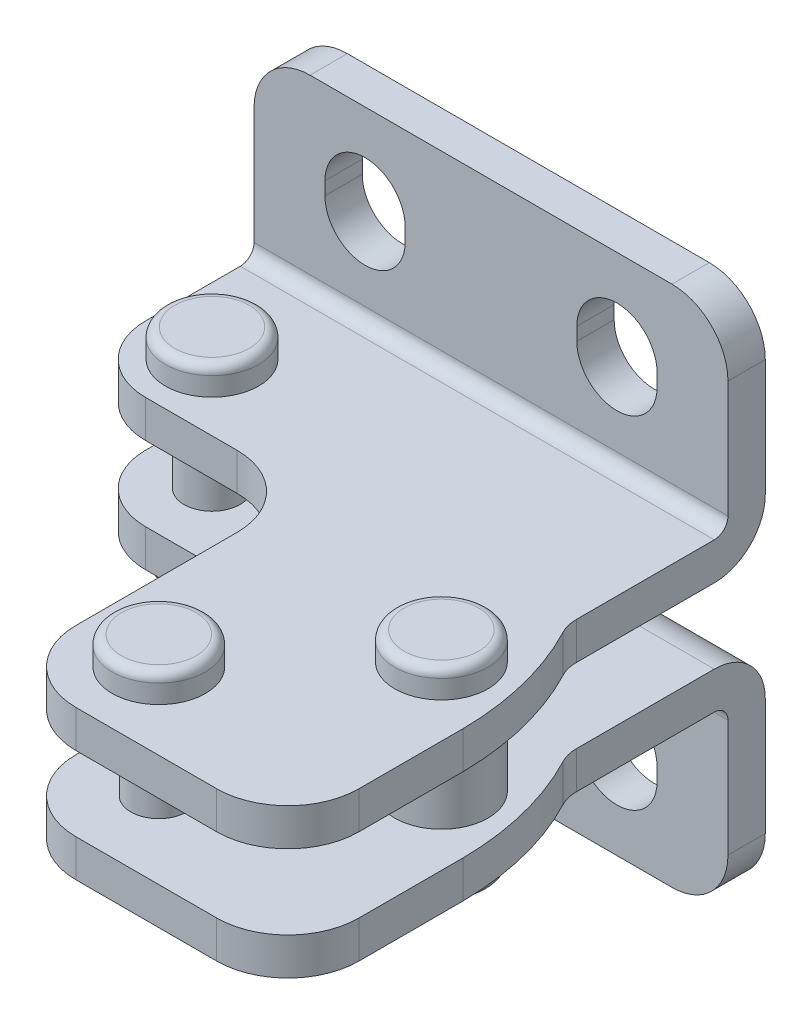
ISO-10303-21;
HEADER;
FILE_DESCRIPTION(('STEP AP214'),'2;1');
FILE_NAME('part.step','',(''),(''),'','','');
FILE_SCHEMA(('AUTOMOTIVE_DESIGN { 1 0 10303 214 1 1 1 1 }'));
ENDSEC;
DATA;
#1=APPLICATION_CONTEXT('core data for automotive mechanical design processes');
#2=APPLICATION_PROTOCOL_DEFINITION('international standard','automotive_design',2000,#1);
#3=PRODUCT_CONTEXT('',#1,'mechanical');
#4=PRODUCT('Part','Part','',(#3));
#5=PRODUCT_RELATED_PRODUCT_CATEGORY('part','',(#4));
#6=PRODUCT_DEFINITION_FORMATION('','',#4);
#7=PRODUCT_DEFINITION_CONTEXT('part definition',#1,'design');
#8=PRODUCT_DEFINITION('design','',#6,#7);
#9=PRODUCT_DEFINITION_SHAPE('','',#8);
#10=(LENGTH_UNIT() NAMED_UNIT(*) SI_UNIT(.MILLI.,.METRE.));
#11=(NAMED_UNIT(*) PLANE_ANGLE_UNIT() SI_UNIT($,.RADIAN.));
#12=(NAMED_UNIT(*) SI_UNIT($,.STERADIAN.) SOLID_ANGLE_UNIT());
#13=UNCERTAINTY_MEASURE_WITH_UNIT(LENGTH_MEASURE(1.E-05),#10,'distance_accuracy_value','');
#14=(GEOMETRIC_REPRESENTATION_CONTEXT(3) GLOBAL_UNCERTAINTY_ASSIGNED_CONTEXT((#13)) GLOBAL_UNIT_ASSIGNED_CONTEXT((#10,
#11,#12)) REPRESENTATION_CONTEXT('',''));
#15=CARTESIAN_POINT('',(0.,0.,0.));
#16=DIRECTION('',(0.,0.,1.));
#17=DIRECTION('',(1.,0.,0.));
#18=AXIS2_PLACEMENT_3D('',#15,#16,#17);
#19=CARTESIAN_POINT('',(2.50820551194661,-2.00000000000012,15.1752778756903));
#20=DIRECTION('',(0.,-1.,0.));
#21=DIRECTION('',(0.99999918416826,0.,-0.00127736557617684));
#22=AXIS2_PLACEMENT_3D('',#19,#20,#21);
#23=PLANE('',#22);
#24=DIRECTION('',(1.02902278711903E-13,0.,1.));
#25=VECTOR('',#24,1.);
#26=CARTESIAN_POINT('',(-5.94999449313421,-1.99999999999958,-6.25732245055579));
#27=LINE('',#26,#25);
#28=CARTESIAN_POINT('',(-5.94999449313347,-1.99999999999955,2.73659999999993));
#29=VERTEX_POINT('',#28);
#30=CARTESIAN_POINT('',(-5.94999449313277,-1.99999999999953,7.80927787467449));
#31=VERTEX_POINT('',#30);
#32=EDGE_CURVE('E951',#29,#31,#27,.T.);
#33=ORIENTED_EDGE('',*,*,#32,.T.);
#34=DIRECTION('',(0.00127736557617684,0.,0.99999918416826));
#35=VECTOR('',#34,1.);
#36=CARTESIAN_POINT('',(-5.94057452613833,-1.99999999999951,15.1860700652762));
#37=LINE('',#36,#35);
#38=CARTESIAN_POINT('',(-5.94999159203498,-1.99999999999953,7.8138201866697));
#39=VERTEX_POINT('',#38);
#40=EDGE_CURVE('E910',#39,#31,#37,.F.);
#41=ORIENTED_EDGE('',*,*,#40,.F.);
#42=CARTESIAN_POINT('',(-2.3939944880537,-1.99999999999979,7.80927787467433));
#43=DIRECTION('',(0.,1.,0.));
#44=DIRECTION('',(-0.99999918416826,0.,0.00127736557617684));
#45=AXIS2_PLACEMENT_3D('',#42,#43,#44);
#46=CIRCLE('',#45,3.55600000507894);
#47=CARTESIAN_POINT('',(-2.39399448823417,-1.99999999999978,11.3652778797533));
#48=VERTEX_POINT('',#47);
#49=EDGE_CURVE('E879',#48,#39,#46,.F.);
#50=ORIENTED_EDGE('',*,*,#49,.F.);
#51=DIRECTION('',(1.,0.,-1.41816463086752E-13));
#52=VECTOR('',#51,1.);
#53=CARTESIAN_POINT('',(2.5082055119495,-2.00000000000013,11.3652778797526));
#54=LINE('',#53,#52);
#55=CARTESIAN_POINT('',(2.50820551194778,-2.00000000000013,11.3652778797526));
#56=VERTEX_POINT('',#55);
#57=EDGE_CURVE('E880',#48,#56,#54,.T.);
#58=ORIENTED_EDGE('',*,*,#57,.T.);
#59=CARTESIAN_POINT('',(2.50820551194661,-2.00000000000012,15.1752778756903));
#60=DIRECTION('',(0.,1.,0.));
#61=DIRECTION('',(-0.99999918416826,0.,0.00127736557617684));
#62=AXIS2_PLACEMENT_3D('',#59,#60,#61);
#63=CIRCLE('',#62,3.80999999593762);
#64=CARTESIAN_POINT('',(6.31820550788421,-2.00000000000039,15.175277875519));
#65=VERTEX_POINT('',#64);
#66=EDGE_CURVE('E883',#56,#65,#63,.F.);
#67=ORIENTED_EDGE('',*,*,#66,.T.);
#68=DIRECTION('',(0.,0.,1.));
#69=VECTOR('',#68,1.);
#70=CARTESIAN_POINT('',(6.31820550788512,-2.00000000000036,23.8112778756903));
#71=LINE('',#70,#69);
#72=CARTESIAN_POINT('',(6.31820550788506,-2.00000000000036,23.8112778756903));
#73=VERTEX_POINT('',#72);
#74=EDGE_CURVE('E886',#65,#73,#71,.T.);
#75=ORIENTED_EDGE('',*,*,#74,.T.);
#76=DIRECTION('',(0.00127736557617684,0.,0.99999918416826));
#77=VECTOR('',#76,1.);
#78=CARTESIAN_POINT('',(6.30716486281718,-2.00000000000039,15.1704252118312));
#79=LINE('',#78,#77);
#80=CARTESIAN_POINT('',(6.31820861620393,-2.00000000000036,23.816144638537));
#81=VERTEX_POINT('',#80);
#82=EDGE_CURVE('E913',#81,#73,#79,.F.);
#83=ORIENTED_EDGE('',*,*,#82,.F.);
#84=CARTESIAN_POINT('',(10.1282055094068,-2.00000000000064,23.8112778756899));
#85=DIRECTION('',(0.,1.,0.));
#86=DIRECTION('',(-0.99999918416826,0.,0.00127736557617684));
#87=AXIS2_PLACEMENT_3D('',#84,#85,#86);
#88=CIRCLE('',#87,3.81000000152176);
#89=CARTESIAN_POINT('',(10.1282055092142,-2.00000000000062,27.6212778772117));
#90=VERTEX_POINT('',#89);
#91=EDGE_CURVE('E890',#90,#81,#88,.F.);
#92=ORIENTED_EDGE('',*,*,#91,.F.);
#93=DIRECTION('',(1.,0.,0.));
#94=VECTOR('',#93,1.);
#95=CARTESIAN_POINT('',(17.6720055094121,-2.00000000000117,27.621277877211));
#96=LINE('',#95,#94);
#97=CARTESIAN_POINT('',(17.6720055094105,-2.00000000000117,27.621277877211));
#98=VERTEX_POINT('',#97);
#99=EDGE_CURVE('E896',#90,#98,#96,.T.);
#100=ORIENTED_EDGE('',*,*,#99,.T.);
#101=CARTESIAN_POINT('',(17.6720055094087,-2.00000000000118,23.8112778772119));
#102=DIRECTION('',(0.,1.,0.));
#103=DIRECTION('',(-0.99999918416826,0.,0.00127736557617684));
#104=AXIS2_PLACEMENT_3D('',#101,#102,#103);
#105=CIRCLE('',#104,3.81000000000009);
#106=CARTESIAN_POINT('',(21.4820055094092,-2.00000000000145,23.8112778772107));
#107=VERTEX_POINT('',#106);
#108=EDGE_CURVE('E902',#107,#98,#105,.F.);
#109=ORIENTED_EDGE('',*,*,#108,.F.);
#110=DIRECTION('',(-1.10366143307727E-13,0.,-1.));
#111=VECTOR('',#110,1.);
#112=CARTESIAN_POINT('',(21.4820055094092,-2.00000000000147,18.223277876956));
#113=LINE('',#112,#111);
#114=CARTESIAN_POINT('',(21.4820055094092,-2.00000000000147,18.2232778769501));
#115=VERTEX_POINT('',#114);
#116=EDGE_CURVE('E905',#107,#115,#113,.T.);
#117=ORIENTED_EDGE('',*,*,#116,.T.);
#118=CARTESIAN_POINT('',(5.82283333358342,-2.00000000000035,18.355140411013));
#119=DIRECTION('',(0.,1.,0.));
#120=DIRECTION('',(-0.99999918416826,0.,0.00127736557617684));
#121=AXIS2_PLACEMENT_3D('',#118,#119,#120);
#122=CIRCLE('',#121,15.6597273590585);
#123=CARTESIAN_POINT('',(19.6801867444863,-2.00000000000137,11.0612513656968));
#124=VERTEX_POINT('',#123);
#125=EDGE_CURVE('E909',#124,#115,#122,.F.);
#126=ORIENTED_EDGE('',*,*,#125,.F.);
#127=CARTESIAN_POINT('',(21.4499944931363,-2.0000000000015,10.1297039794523));
#128=DIRECTION('',(0.,1.,0.));
#129=DIRECTION('',(-0.99999918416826,0.,0.00127736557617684));
#130=AXIS2_PLACEMENT_3D('',#127,#128,#129);
#131=CIRCLE('',#130,2.);
#132=CARTESIAN_POINT('',(19.4499969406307,-2.00000000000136,10.1322587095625));
#133=VERTEX_POINT('',#132);
#134=EDGE_CURVE('E917',#133,#124,#131,.T.);
#135=ORIENTED_EDGE('',*,*,#134,.F.);
#136=DIRECTION('',(0.00127736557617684,0.,0.99999918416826));
#137=VECTOR('',#136,1.);
#138=CARTESIAN_POINT('',(19.4564118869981,-2.00000000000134,15.1536288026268));
#139=LINE('',#138,#137);
#140=CARTESIAN_POINT('',(19.4499944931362,-2.00000000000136,10.1297039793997));
#141=VERTEX_POINT('',#140);
#142=EDGE_CURVE('E920',#141,#133,#139,.T.);
#143=ORIENTED_EDGE('',*,*,#142,.F.);
#144=DIRECTION('',(0.,0.,-1.));
#145=VECTOR('',#144,1.);
#146=CARTESIAN_POINT('',(19.4499944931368,-2.00000000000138,2.18323245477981));
#147=LINE('',#146,#145);
#148=CARTESIAN_POINT('',(19.4499944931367,-2.00000000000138,2.73659999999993));
#149=VERTEX_POINT('',#148);
#150=EDGE_CURVE('E935',#141,#149,#147,.T.);
#151=ORIENTED_EDGE('',*,*,#150,.T.);
#152=DIRECTION('',(1.,0.,0.));
#153=VECTOR('',#152,1.);
#154=CARTESIAN_POINT('',(-5.94999449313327,-1.99999999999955,2.73659999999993));
#155=LINE('',#154,#153);
#156=EDGE_CURVE('E912',#29,#149,#155,.T.);
#157=ORIENTED_EDGE('',*,*,#156,.F.);
#158=EDGE_LOOP('',(#33,#41,#50,#58,#67,#75,#83,#92,#100,#109,#117,#126,#135,#143,#151,#157));
#159=FACE_BOUND('',#158,.T.);
#160=CARTESIAN_POINT('',(10.4489304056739,-2.00000000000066,23.5023527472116));
#161=DIRECTION('',(0.,-1.,0.));
#162=DIRECTION('',(0.99999918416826,0.,-0.00127736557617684));
#163=AXIS2_PLACEMENT_3D('',#160,#161,#162);
#164=CIRCLE('',#163,1.5);
#165=CARTESIAN_POINT('',(11.9489291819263,-2.00000000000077,23.5004366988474));
#166=VERTEX_POINT('',#165);
#167=EDGE_CURVE('E639',#166,#166,#164,.F.);
#168=ORIENTED_EDGE('',*,*,#167,.F.);
#169=EDGE_LOOP('',(#168));
#170=FACE_BOUND('',#169,.T.);
#171=CARTESIAN_POINT('',(-2.3939944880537,-1.99999999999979,7.80927787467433));
#172=DIRECTION('',(0.,1.,0.));
#173=DIRECTION('',(-0.99999918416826,0.,0.00127736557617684));
#174=AXIS2_PLACEMENT_3D('',#171,#172,#173);
#175=CIRCLE('',#174,1.5);
#176=CARTESIAN_POINT('',(-3.89399326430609,-1.99999999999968,7.8111939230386));
#177=VERTEX_POINT('',#176);
#178=EDGE_CURVE('E846',#177,#177,#175,.F.);
#179=ORIENTED_EDGE('',*,*,#178,.T.);
#180=EDGE_LOOP('',(#179));
#181=FACE_BOUND('',#180,.T.);
#182=CARTESIAN_POINT('',(17.8061642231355,-2.00000000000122,15.7149492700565));
#183=DIRECTION('',(0.,-1.,0.));
#184=DIRECTION('',(1.,0.,0.));
#185=AXIS2_PLACEMENT_3D('',#182,#183,#184);
#186=CIRCLE('',#185,2.5);
#187=CARTESIAN_POINT('',(20.3061642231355,-2.0000000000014,15.7149492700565));
#188=VERTEX_POINT('',#187);
#189=EDGE_CURVE('E22',#188,#188,#186,.T.);
#190=ORIENTED_EDGE('',*,*,#189,.T.);
#191=EDGE_LOOP('',(#190));
#192=FACE_BOUND('',#191,.T.);
#193=ADVANCED_FACE('F14',(#159,#170,#181,#192),#23,.F.);
#194=CARTESIAN_POINT('',(2.50820551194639,1.99999999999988,15.1752778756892));
#195=DIRECTION('',(0.,-1.,0.));
#196=DIRECTION('',(0.99999918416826,0.,-0.00127736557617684));
#197=AXIS2_PLACEMENT_3D('',#194,#195,#196);
#198=PLANE('',#197);
#199=CARTESIAN_POINT('',(17.8061642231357,1.99999999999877,15.7149492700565));
#200=DIRECTION('',(0.,-1.,0.));
#201=DIRECTION('',(1.,0.,0.));
#202=AXIS2_PLACEMENT_3D('',#199,#200,#201);
#203=CIRCLE('',#202,2.5);
#204=CARTESIAN_POINT('',(20.3061642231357,1.99999999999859,15.7149492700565));
#205=VERTEX_POINT('',#204);
#206=EDGE_CURVE('E9',#205,#205,#203,.T.);
#207=ORIENTED_EDGE('',*,*,#206,.F.);
#208=EDGE_LOOP('',(#207));
#209=FACE_BOUND('',#208,.T.);
#210=CARTESIAN_POINT('',(-2.39399448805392,2.00000000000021,7.8092778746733));
#211=DIRECTION('',(0.,1.,0.));
#212=DIRECTION('',(-0.99999918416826,0.,0.00127736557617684));
#213=AXIS2_PLACEMENT_3D('',#210,#211,#212);
#214=CIRCLE('',#213,1.5);
#215=CARTESIAN_POINT('',(-3.89399326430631,2.00000000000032,7.81119392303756));
#216=VERTEX_POINT('',#215);
#217=EDGE_CURVE('E843',#216,#216,#214,.T.);
#218=ORIENTED_EDGE('',*,*,#217,.T.);
#219=EDGE_LOOP('',(#218));
#220=FACE_BOUND('',#219,.T.);
#221=CARTESIAN_POINT('',(10.4489304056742,1.99999999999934,23.5023527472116));
#222=DIRECTION('',(0.,-1.,0.));
#223=DIRECTION('',(0.99999918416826,0.,-0.00127736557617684));
#224=AXIS2_PLACEMENT_3D('',#221,#222,#223);
#225=CIRCLE('',#224,1.5);
#226=CARTESIAN_POINT('',(11.9489291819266,1.99999999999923,23.5004366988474));
#227=VERTEX_POINT('',#226);
#228=EDGE_CURVE('E631',#227,#227,#225,.F.);
#229=ORIENTED_EDGE('',*,*,#228,.T.);
#230=EDGE_LOOP('',(#229));
#231=FACE_BOUND('',#230,.T.);
#232=DIRECTION('',(0.00127736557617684,0.,0.99999918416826));
#233=VECTOR('',#232,1.);
#234=CARTESIAN_POINT('',(-5.94057452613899,2.00000000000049,15.1860700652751));
#235=LINE('',#234,#233);
#236=CARTESIAN_POINT('',(-5.94999159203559,2.00000000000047,7.81382018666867));
#237=VERTEX_POINT('',#236);
#238=CARTESIAN_POINT('',(-5.94999449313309,2.00000000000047,7.80927787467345));
#239=VERTEX_POINT('',#238);
#240=EDGE_CURVE('E749',#237,#239,#235,.F.);
#241=ORIENTED_EDGE('',*,*,#240,.T.);
#242=DIRECTION('',(1.01720281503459E-13,0.,1.));
#243=VECTOR('',#242,1.);
#244=CARTESIAN_POINT('',(-5.94999449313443,2.00000000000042,-6.2573224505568));
#245=LINE('',#244,#243);
#246=CARTESIAN_POINT('',(-5.94999449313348,2.00000000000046,2.73659999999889));
#247=VERTEX_POINT('',#246);
#248=EDGE_CURVE('E784',#239,#247,#245,.F.);
#249=ORIENTED_EDGE('',*,*,#248,.T.);
#250=DIRECTION('',(1.,0.,0.));
#251=VECTOR('',#250,1.);
#252=CARTESIAN_POINT('',(-5.94999449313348,2.00000000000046,2.73659999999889));
#253=LINE('',#252,#251);
#254=CARTESIAN_POINT('',(19.4499944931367,1.99999999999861,2.7365999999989));
#255=VERTEX_POINT('',#254);
#256=EDGE_CURVE('E760',#247,#255,#253,.T.);
#257=ORIENTED_EDGE('',*,*,#256,.T.);
#258=DIRECTION('',(0.,0.,-1.));
#259=VECTOR('',#258,1.);
#260=CARTESIAN_POINT('',(19.4499944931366,1.99999999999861,2.18323245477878));
#261=LINE('',#260,#259);
#262=CARTESIAN_POINT('',(19.4499944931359,1.99999999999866,10.1297039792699));
#263=VERTEX_POINT('',#262);
#264=EDGE_CURVE('E772',#255,#263,#261,.F.);
#265=ORIENTED_EDGE('',*,*,#264,.T.);
#266=DIRECTION('',(0.00127736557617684,0.,0.99999918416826));
#267=VECTOR('',#266,1.);
#268=CARTESIAN_POINT('',(19.4564118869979,1.99999999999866,15.1536288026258));
#269=LINE('',#268,#267);
#270=CARTESIAN_POINT('',(19.4499969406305,1.99999999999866,10.1322587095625));
#271=VERTEX_POINT('',#270);
#272=EDGE_CURVE('E758',#263,#271,#269,.T.);
#273=ORIENTED_EDGE('',*,*,#272,.T.);
#274=CARTESIAN_POINT('',(21.449994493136,1.99999999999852,10.1297039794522));
#275=DIRECTION('',(0.,1.,0.));
#276=DIRECTION('',(-0.99999918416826,0.,0.00127736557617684));
#277=AXIS2_PLACEMENT_3D('',#274,#275,#276);
#278=CIRCLE('',#277,2.);
#279=CARTESIAN_POINT('',(19.6801867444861,1.99999999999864,11.0612513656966));
#280=VERTEX_POINT('',#279);
#281=EDGE_CURVE('E755',#271,#280,#278,.T.);
#282=ORIENTED_EDGE('',*,*,#281,.T.);
#283=CARTESIAN_POINT('',(5.82283333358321,1.99999999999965,18.3551404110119));
#284=DIRECTION('',(0.,1.,0.));
#285=DIRECTION('',(-0.99999918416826,0.,0.00127736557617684));
#286=AXIS2_PLACEMENT_3D('',#283,#284,#285);
#287=CIRCLE('',#286,15.659727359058);
#288=CARTESIAN_POINT('',(21.4820055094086,1.99999999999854,18.2232778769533));
#289=VERTEX_POINT('',#288);
#290=EDGE_CURVE('E748',#289,#280,#287,.T.);
#291=ORIENTED_EDGE('',*,*,#290,.F.);
#292=DIRECTION('',(0.,0.,-1.));
#293=VECTOR('',#292,1.);
#294=CARTESIAN_POINT('',(21.4820055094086,1.99999999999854,18.2232778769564));
#295=LINE('',#294,#293);
#296=CARTESIAN_POINT('',(21.4820055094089,1.99999999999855,23.8112778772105));
#297=VERTEX_POINT('',#296);
#298=EDGE_CURVE('E744',#289,#297,#295,.F.);
#299=ORIENTED_EDGE('',*,*,#298,.T.);
#300=CARTESIAN_POINT('',(17.6720055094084,1.99999999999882,23.8112778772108));
#301=DIRECTION('',(0.,1.,0.));
#302=DIRECTION('',(-0.99999918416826,0.,0.00127736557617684));
#303=AXIS2_PLACEMENT_3D('',#300,#301,#302);
#304=CIRCLE('',#303,3.81000000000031);
#305=CARTESIAN_POINT('',(17.6720055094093,1.99999999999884,27.621277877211));
#306=VERTEX_POINT('',#305);
#307=EDGE_CURVE('E740',#306,#297,#304,.T.);
#308=ORIENTED_EDGE('',*,*,#307,.F.);
#309=DIRECTION('',(1.,0.,0.));
#310=VECTOR('',#309,1.);
#311=CARTESIAN_POINT('',(17.6720055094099,1.99999999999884,27.621277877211));
#312=LINE('',#311,#310);
#313=CARTESIAN_POINT('',(10.128205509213,1.99999999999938,27.6212778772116));
#314=VERTEX_POINT('',#313);
#315=EDGE_CURVE('E737',#306,#314,#312,.F.);
#316=ORIENTED_EDGE('',*,*,#315,.T.);
#317=CARTESIAN_POINT('',(10.1282055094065,1.99999999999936,23.8112778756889));
#318=DIRECTION('',(0.,1.,0.));
#319=DIRECTION('',(-0.99999918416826,0.,0.00127736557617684));
#320=AXIS2_PLACEMENT_3D('',#317,#318,#319);
#321=CIRCLE('',#320,3.81000000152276);
#322=CARTESIAN_POINT('',(6.31820861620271,1.99999999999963,23.816144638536));
#323=VERTEX_POINT('',#322);
#324=EDGE_CURVE('E733',#323,#314,#321,.T.);
#325=ORIENTED_EDGE('',*,*,#324,.F.);
#326=DIRECTION('',(0.00127736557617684,0.,0.99999918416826));
#327=VECTOR('',#326,1.);
#328=CARTESIAN_POINT('',(6.30716486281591,1.99999999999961,15.1704252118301));
#329=LINE('',#328,#327);
#330=CARTESIAN_POINT('',(6.31820550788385,1.99999999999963,23.8112778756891));
#331=VERTEX_POINT('',#330);
#332=EDGE_CURVE('E751',#323,#331,#329,.F.);
#333=ORIENTED_EDGE('',*,*,#332,.T.);
#334=DIRECTION('',(0.,0.,1.));
#335=VECTOR('',#334,1.);
#336=CARTESIAN_POINT('',(6.31820550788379,1.99999999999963,23.8112778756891));
#337=LINE('',#336,#335);
#338=CARTESIAN_POINT('',(6.31820550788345,1.99999999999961,15.1752778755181));
#339=VERTEX_POINT('',#338);
#340=EDGE_CURVE('E725',#331,#339,#337,.F.);
#341=ORIENTED_EDGE('',*,*,#340,.T.);
#342=CARTESIAN_POINT('',(2.50820551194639,1.99999999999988,15.1752778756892));
#343=DIRECTION('',(0.,1.,0.));
#344=DIRECTION('',(-0.99999918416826,0.,0.00127736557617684));
#345=AXIS2_PLACEMENT_3D('',#342,#343,#344);
#346=CIRCLE('',#345,3.80999999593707);
#347=CARTESIAN_POINT('',(2.50820551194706,1.99999999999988,11.3652778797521));
#348=VERTEX_POINT('',#347);
#349=EDGE_CURVE('E721',#339,#348,#346,.T.);
#350=ORIENTED_EDGE('',*,*,#349,.T.);
#351=DIRECTION('',(1.,0.,-1.05014304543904E-13));
#352=VECTOR('',#351,1.);
#353=CARTESIAN_POINT('',(2.50820551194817,1.99999999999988,11.3652778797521));
#354=LINE('',#353,#352);
#355=CARTESIAN_POINT('',(-2.39399448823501,2.00000000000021,11.3652778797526));
#356=VERTEX_POINT('',#355);
#357=EDGE_CURVE('E720',#348,#356,#354,.F.);
#358=ORIENTED_EDGE('',*,*,#357,.T.);
#359=CARTESIAN_POINT('',(-2.39399448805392,2.00000000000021,7.8092778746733));
#360=DIRECTION('',(0.,1.,0.));
#361=DIRECTION('',(-0.99999918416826,0.,0.00127736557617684));
#362=AXIS2_PLACEMENT_3D('',#359,#360,#361);
#363=CIRCLE('',#362,3.55600000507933);
#364=EDGE_CURVE('E716',#237,#356,#363,.T.);
#365=ORIENTED_EDGE('',*,*,#364,.F.);
#366=EDGE_LOOP('',(#241,#249,#257,#265,#273,#282,#291,#299,#308,#316,#325,#333,#341,#350,#358,#365));
#367=FACE_BOUND('',#366,.T.);
#368=ADVANCED_FACE('F1087',(#209,#220,#231,#367),#198,.T.);
#369=CARTESIAN_POINT('',(-2.39399448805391,-3.99999999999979,7.80927787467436));
#370=DIRECTION('',(0.,1.,0.));
#371=DIRECTION('',(-0.99999918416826,0.,0.00127736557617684));
#372=AXIS2_PLACEMENT_3D('',#369,#370,#371);
#373=CYLINDRICAL_SURFACE('',#372,1.5);
#374=ORIENTED_EDGE('',*,*,#217,.F.);
#375=EDGE_LOOP('',(#374));
#376=FACE_BOUND('',#375,.T.);
#377=ORIENTED_EDGE('',*,*,#178,.F.);
#378=EDGE_LOOP('',(#377));
#379=FACE_BOUND('',#378,.T.);
#380=ADVANCED_FACE('F1095',(#376,#379),#373,.T.);
#381=CARTESIAN_POINT('',(10.4489304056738,-4.00000000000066,23.5023527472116));
#382=DIRECTION('',(0.,1.,0.));
#383=DIRECTION('',(-0.99999918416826,0.,0.00127736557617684));
#384=AXIS2_PLACEMENT_3D('',#381,#382,#383);
#385=CYLINDRICAL_SURFACE('',#384,1.5);
#386=ORIENTED_EDGE('',*,*,#228,.F.);
#387=EDGE_LOOP('',(#386));
#388=FACE_BOUND('',#387,.T.);
#389=ORIENTED_EDGE('',*,*,#167,.T.);
#390=EDGE_LOOP('',(#389));
#391=FACE_BOUND('',#390,.T.);
#392=ADVANCED_FACE('F1149',(#388,#391),#385,.T.);
#393=CARTESIAN_POINT('',(-2.39399448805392,2.00000000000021,7.8092778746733));
#394=DIRECTION('',(0.,1.,0.));
#395=DIRECTION('',(-0.99999918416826,0.,0.00127736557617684));
#396=AXIS2_PLACEMENT_3D('',#393,#394,#395);
#397=CYLINDRICAL_SURFACE('',#396,3.55600000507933);
#398=DIRECTION('',(0.,1.,0.));
#399=VECTOR('',#398,1.);
#400=CARTESIAN_POINT('',(-2.39399448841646,2.00000000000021,11.3652778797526));
#401=LINE('',#400,#399);
#402=CARTESIAN_POINT('',(-2.39399448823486,4.00000000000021,11.3652778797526));
#403=VERTEX_POINT('',#402);
#404=EDGE_CURVE('E713',#356,#403,#401,.T.);
#405=ORIENTED_EDGE('',*,*,#404,.T.);
#406=CARTESIAN_POINT('',(-2.39399448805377,4.00000000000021,7.80927787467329));
#407=DIRECTION('',(0.,1.,0.));
#408=DIRECTION('',(-0.99999918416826,0.,0.00127736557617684));
#409=AXIS2_PLACEMENT_3D('',#406,#407,#408);
#410=CIRCLE('',#409,3.55600000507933);
#411=CARTESIAN_POINT('',(-5.94999449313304,4.00000000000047,7.80927787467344));
#412=VERTEX_POINT('',#411);
#413=EDGE_CURVE('E697',#403,#412,#410,.F.);
#414=ORIENTED_EDGE('',*,*,#413,.T.);
#415=DIRECTION('',(0.,-1.,0.));
#416=VECTOR('',#415,1.);
#417=CARTESIAN_POINT('',(-5.94999449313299,2.00000000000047,7.80927787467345));
#418=LINE('',#417,#416);
#419=EDGE_CURVE('E715',#412,#239,#418,.T.);
#420=ORIENTED_EDGE('',*,*,#419,.T.);
#421=ORIENTED_EDGE('',*,*,#240,.F.);
#422=ORIENTED_EDGE('',*,*,#364,.T.);
#423=EDGE_LOOP('',(#405,#414,#420,#421,#422));
#424=FACE_BOUND('',#423,.T.);
#425=ADVANCED_FACE('F1152',(#424),#397,.T.);
#426=CARTESIAN_POINT('',(-5.94999449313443,2.00000000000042,-6.2573224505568));
#427=DIRECTION('',(1.,0.,-1.01720498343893E-13));
#428=DIRECTION('',(1.01720281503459E-13,0.,1.));
#429=AXIS2_PLACEMENT_3D('',#426,#427,#428);
#430=PLANE('',#429);
#431=DIRECTION('',(0.,-1.,0.));
#432=VECTOR('',#431,1.);
#433=CARTESIAN_POINT('',(-5.94999449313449,-10.4299227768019,1.99999999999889));
#434=LINE('',#433,#432);
#435=CARTESIAN_POINT('',(-5.94999449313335,4.73660000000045,1.99999999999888));
#436=VERTEX_POINT('',#435);
#437=CARTESIAN_POINT('',(-5.94999449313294,11.0000000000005,1.99999999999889));
#438=VERTEX_POINT('',#437);
#439=EDGE_CURVE('E788',#436,#438,#434,.F.);
#440=ORIENTED_EDGE('',*,*,#439,.T.);
#441=DIRECTION('',(1.01720281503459E-13,0.,1.));
#442=VECTOR('',#441,1.);
#443=CARTESIAN_POINT('',(-5.94999449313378,11.0000000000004,-6.25732245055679));
#444=LINE('',#443,#442);
#445=CARTESIAN_POINT('',(-5.9499944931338,11.0000000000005,-1.13731452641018E-12));
#446=VERTEX_POINT('',#445);
#447=EDGE_CURVE('E1055',#438,#446,#444,.F.);
#448=ORIENTED_EDGE('',*,*,#447,.T.);
#449=DIRECTION('',(0.,-1.,0.));
#450=VECTOR('',#449,1.);
#451=CARTESIAN_POINT('',(-5.9499944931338,11.0026775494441,-1.13732381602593E-12));
#452=LINE('',#451,#450);
#453=CARTESIAN_POINT('',(-5.94999449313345,4.73660000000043,-1.11660551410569E-12));
#454=VERTEX_POINT('',#453);
#455=EDGE_CURVE('E823',#454,#446,#452,.F.);
#456=ORIENTED_EDGE('',*,*,#455,.F.);
#457=CARTESIAN_POINT('',(-5.94999449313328,4.73660000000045,2.73659999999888));
#458=DIRECTION('',(1.,0.,0.));
#459=DIRECTION('',(0.,0.,1.));
#460=AXIS2_PLACEMENT_3D('',#457,#458,#459);
#461=CIRCLE('',#460,2.7366);
#462=EDGE_CURVE('E791',#454,#247,#461,.F.);
#463=ORIENTED_EDGE('',*,*,#462,.T.);
#464=ORIENTED_EDGE('',*,*,#248,.F.);
#465=ORIENTED_EDGE('',*,*,#419,.F.);
#466=DIRECTION('',(0.,0.,-1.));
#467=VECTOR('',#466,1.);
#468=CARTESIAN_POINT('',(-5.94999449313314,4.00000000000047,7.80927787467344));
#469=LINE('',#468,#467);
#470=CARTESIAN_POINT('',(-5.94999449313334,4.00000000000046,2.73659999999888));
#471=VERTEX_POINT('',#470);
#472=EDGE_CURVE('E771',#412,#471,#469,.T.);
#473=ORIENTED_EDGE('',*,*,#472,.T.);
#474=CARTESIAN_POINT('',(-5.94999449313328,4.73660000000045,2.73659999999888));
#475=DIRECTION('',(1.,0.,0.));
#476=DIRECTION('',(0.,0.,1.));
#477=AXIS2_PLACEMENT_3D('',#474,#475,#476);
#478=CIRCLE('',#477,0.7366);
#479=EDGE_CURVE('E820',#471,#436,#478,.T.);
#480=ORIENTED_EDGE('',*,*,#479,.T.);
#481=EDGE_LOOP('',(#440,#448,#456,#463,#464,#465,#473,#480));
#482=FACE_BOUND('',#481,.T.);
#483=ADVANCED_FACE('F1409',(#482),#430,.F.);
#484=CARTESIAN_POINT('',(-18.8811255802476,4.73660000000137,2.73659999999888));
#485=DIRECTION('',(1.,0.,0.));
#486=DIRECTION('',(0.,0.,1.));
#487=AXIS2_PLACEMENT_3D('',#484,#485,#486);
#488=CYLINDRICAL_SURFACE('',#487,2.7366);
#489=DIRECTION('',(1.,0.,0.));
#490=VECTOR('',#489,1.);
#491=CARTESIAN_POINT('',(-18.8811255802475,4.73660000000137,-1.12541296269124E-12));
#492=LINE('',#491,#490);
#493=CARTESIAN_POINT('',(19.449994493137,4.73659999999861,-1.08970544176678E-12));
#494=VERTEX_POINT('',#493);
#495=EDGE_CURVE('E817',#454,#494,#492,.T.);
#496=ORIENTED_EDGE('',*,*,#495,.T.);
#497=CARTESIAN_POINT('',(19.4499944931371,4.73659999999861,2.73659999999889));
#498=DIRECTION('',(1.,0.,0.));
#499=DIRECTION('',(0.,0.,1.));
#500=AXIS2_PLACEMENT_3D('',#497,#498,#499);
#501=CIRCLE('',#500,2.7366);
#502=EDGE_CURVE('E779',#255,#494,#501,.T.);
#503=ORIENTED_EDGE('',*,*,#502,.F.);
#504=ORIENTED_EDGE('',*,*,#256,.F.);
#505=ORIENTED_EDGE('',*,*,#462,.F.);
#506=EDGE_LOOP('',(#496,#503,#504,#505));
#507=FACE_BOUND('',#506,.T.);
#508=ADVANCED_FACE('F1204',(#507),#488,.T.);
#509=CARTESIAN_POINT('',(19.4499944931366,1.99999999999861,2.18323245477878));
#510=DIRECTION('',(-1.,0.,0.));
#511=DIRECTION('',(0.,0.,-1.));
#512=AXIS2_PLACEMENT_3D('',#509,#510,#511);
#513=PLANE('',#512);
#514=DIRECTION('',(-1.48803982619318E-13,-1.,0.));
#515=VECTOR('',#514,1.);
#516=CARTESIAN_POINT('',(19.4499944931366,2.56212264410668,-1.06104298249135E-12));
#517=LINE('',#516,#515);
#518=CARTESIAN_POINT('',(19.4499944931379,10.9999999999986,-1.09114784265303E-12));
#519=VERTEX_POINT('',#518);
#520=EDGE_CURVE('E821',#519,#494,#517,.T.);
#521=ORIENTED_EDGE('',*,*,#520,.F.);
#522=DIRECTION('',(0.,0.,1.));
#523=VECTOR('',#522,1.);
#524=CARTESIAN_POINT('',(19.4499944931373,10.9999999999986,2.18323245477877));
#525=LINE('',#524,#523);
#526=CARTESIAN_POINT('',(19.449994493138,10.9999999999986,1.9999999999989));
#527=VERTEX_POINT('',#526);
#528=EDGE_CURVE('E1020',#519,#527,#525,.T.);
#529=ORIENTED_EDGE('',*,*,#528,.T.);
#530=DIRECTION('',(0.,-1.,0.));
#531=VECTOR('',#530,1.);
#532=CARTESIAN_POINT('',(19.4499944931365,-10.4299227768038,1.9999999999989));
#533=LINE('',#532,#531);
#534=CARTESIAN_POINT('',(19.4499944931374,4.73659999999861,1.99999999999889));
#535=VERTEX_POINT('',#534);
#536=EDGE_CURVE('E785',#527,#535,#533,.T.);
#537=ORIENTED_EDGE('',*,*,#536,.T.);
#538=CARTESIAN_POINT('',(19.4499944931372,4.73659999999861,2.73659999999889));
#539=DIRECTION('',(1.,0.,0.));
#540=DIRECTION('',(0.,0.,1.));
#541=AXIS2_PLACEMENT_3D('',#538,#539,#540);
#542=CIRCLE('',#541,0.7366);
#543=CARTESIAN_POINT('',(19.4499944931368,3.99999999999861,2.7365999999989));
#544=VERTEX_POINT('',#543);
#545=EDGE_CURVE('E783',#535,#544,#542,.F.);
#546=ORIENTED_EDGE('',*,*,#545,.T.);
#547=DIRECTION('',(0.,0.,1.));
#548=VECTOR('',#547,1.);
#549=CARTESIAN_POINT('',(19.4499944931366,3.99999999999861,2.7365999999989));
#550=LINE('',#549,#548);
#551=CARTESIAN_POINT('',(19.4499944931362,3.99999999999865,10.129703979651));
#552=VERTEX_POINT('',#551);
#553=EDGE_CURVE('E763',#544,#552,#550,.T.);
#554=ORIENTED_EDGE('',*,*,#553,.T.);
#555=DIRECTION('',(0.,-1.,0.));
#556=VECTOR('',#555,1.);
#557=CARTESIAN_POINT('',(19.449994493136,1.99999999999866,10.1297039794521));
#558=LINE('',#557,#556);
#559=EDGE_CURVE('E775',#263,#552,#558,.F.);
#560=ORIENTED_EDGE('',*,*,#559,.F.);
#561=ORIENTED_EDGE('',*,*,#264,.F.);
#562=ORIENTED_EDGE('',*,*,#502,.T.);
#563=EDGE_LOOP('',(#521,#529,#537,#546,#554,#560,#561,#562));
#564=FACE_BOUND('',#563,.T.);
#565=ADVANCED_FACE('F1408',(#564),#513,.F.);
#566=CARTESIAN_POINT('',(21.449994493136,1.99999999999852,10.1297039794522));
#567=DIRECTION('',(0.,1.,0.));
#568=DIRECTION('',(-0.99999918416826,0.,0.00127736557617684));
#569=AXIS2_PLACEMENT_3D('',#566,#567,#568);
#570=CYLINDRICAL_SURFACE('',#569,2.);
#571=ORIENTED_EDGE('',*,*,#272,.F.);
#572=ORIENTED_EDGE('',*,*,#559,.T.);
#573=CARTESIAN_POINT('',(21.4499944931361,3.99999999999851,10.1297039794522));
#574=DIRECTION('',(0.,1.,0.));
#575=DIRECTION('',(-0.99999918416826,0.,0.00127736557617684));
#576=AXIS2_PLACEMENT_3D('',#573,#574,#575);
#577=CIRCLE('',#576,2.);
#578=CARTESIAN_POINT('',(19.6801867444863,3.99999999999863,11.0612513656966));
#579=VERTEX_POINT('',#578);
#580=EDGE_CURVE('E787',#579,#552,#577,.F.);
#581=ORIENTED_EDGE('',*,*,#580,.F.);
#582=DIRECTION('',(0.,1.,0.));
#583=VECTOR('',#582,1.);
#584=CARTESIAN_POINT('',(19.6801867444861,1.99999999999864,11.0612513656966));
#585=LINE('',#584,#583);
#586=EDGE_CURVE('E745',#280,#579,#585,.T.);
#587=ORIENTED_EDGE('',*,*,#586,.F.);
#588=ORIENTED_EDGE('',*,*,#281,.F.);
#589=EDGE_LOOP('',(#571,#572,#581,#587,#588));
#590=FACE_BOUND('',#589,.T.);
#591=ADVANCED_FACE('F1099',(#590),#570,.F.);
#592=CARTESIAN_POINT('',(5.82283333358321,1.99999999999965,18.3551404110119));
#593=DIRECTION('',(0.,1.,0.));
#594=DIRECTION('',(-0.99999918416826,0.,0.00127736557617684));
#595=AXIS2_PLACEMENT_3D('',#592,#593,#594);
#596=CYLINDRICAL_SURFACE('',#595,15.659727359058);
#597=ORIENTED_EDGE('',*,*,#290,.T.);
#598=ORIENTED_EDGE('',*,*,#586,.T.);
#599=CARTESIAN_POINT('',(5.82283333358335,3.99999999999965,18.3551404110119));
#600=DIRECTION('',(0.,1.,0.));
#601=DIRECTION('',(-0.99999918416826,0.,0.00127736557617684));
#602=AXIS2_PLACEMENT_3D('',#599,#600,#601);
#603=CIRCLE('',#602,15.659727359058);
#604=CARTESIAN_POINT('',(21.4820055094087,3.99999999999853,18.2232778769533));
#605=VERTEX_POINT('',#604);
#606=EDGE_CURVE('E712',#579,#605,#603,.F.);
#607=ORIENTED_EDGE('',*,*,#606,.T.);
#608=DIRECTION('',(0.,-1.,0.));
#609=VECTOR('',#608,1.);
#610=CARTESIAN_POINT('',(21.4820055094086,1.99999999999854,18.2232778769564));
#611=LINE('',#610,#609);
#612=EDGE_CURVE('E741',#605,#289,#611,.T.);
#613=ORIENTED_EDGE('',*,*,#612,.T.);
#614=EDGE_LOOP('',(#597,#598,#607,#613));
#615=FACE_BOUND('',#614,.T.);
#616=ADVANCED_FACE('F1098',(#615),#596,.T.);
#617=CARTESIAN_POINT('',(21.4820055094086,1.99999999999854,18.2232778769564));
#618=DIRECTION('',(-1.,0.,0.));
#619=DIRECTION('',(0.,0.,-1.));
#620=AXIS2_PLACEMENT_3D('',#617,#618,#619);
#621=PLANE('',#620);
#622=DIRECTION('',(0.,1.,0.));
#623=VECTOR('',#622,1.);
#624=CARTESIAN_POINT('',(21.4820055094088,1.99999999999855,23.8112778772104));
#625=LINE('',#624,#623);
#626=CARTESIAN_POINT('',(21.482005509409,3.99999999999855,23.8112778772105));
#627=VERTEX_POINT('',#626);
#628=EDGE_CURVE('E738',#297,#627,#625,.T.);
#629=ORIENTED_EDGE('',*,*,#628,.F.);
#630=ORIENTED_EDGE('',*,*,#298,.F.);
#631=ORIENTED_EDGE('',*,*,#612,.F.);
#632=DIRECTION('',(0.,0.,1.));
#633=VECTOR('',#632,1.);
#634=CARTESIAN_POINT('',(21.4820055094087,3.99999999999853,18.2232778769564));
#635=LINE('',#634,#633);
#636=EDGE_CURVE('E709',#605,#627,#635,.T.);
#637=ORIENTED_EDGE('',*,*,#636,.T.);
#638=EDGE_LOOP('',(#629,#630,#631,#637));
#639=FACE_BOUND('',#638,.T.);
#640=ADVANCED_FACE('F1583',(#639),#621,.F.);
#641=CARTESIAN_POINT('',(17.6720055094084,1.99999999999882,23.8112778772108));
#642=DIRECTION('',(0.,1.,0.));
#643=DIRECTION('',(-0.99999918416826,0.,0.00127736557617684));
#644=AXIS2_PLACEMENT_3D('',#641,#642,#643);
#645=CYLINDRICAL_SURFACE('',#644,3.81000000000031);
#646=ORIENTED_EDGE('',*,*,#307,.T.);
#647=ORIENTED_EDGE('',*,*,#628,.T.);
#648=CARTESIAN_POINT('',(17.6720055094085,3.99999999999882,23.8112778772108));
#649=DIRECTION('',(0.,1.,0.));
#650=DIRECTION('',(-0.99999918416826,0.,0.00127736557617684));
#651=AXIS2_PLACEMENT_3D('',#648,#649,#650);
#652=CIRCLE('',#651,3.81000000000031);
#653=CARTESIAN_POINT('',(17.6720055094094,3.99999999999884,27.6212778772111));
#654=VERTEX_POINT('',#653);
#655=EDGE_CURVE('E708',#627,#654,#652,.F.);
#656=ORIENTED_EDGE('',*,*,#655,.T.);
#657=DIRECTION('',(0.,-1.,0.));
#658=VECTOR('',#657,1.);
#659=CARTESIAN_POINT('',(17.6720055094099,1.99999999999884,27.621277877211));
#660=LINE('',#659,#658);
#661=EDGE_CURVE('E734',#654,#306,#660,.T.);
#662=ORIENTED_EDGE('',*,*,#661,.T.);
#663=EDGE_LOOP('',(#646,#647,#656,#662));
#664=FACE_BOUND('',#663,.T.);
#665=ADVANCED_FACE('F1574',(#664),#645,.T.);
#666=CARTESIAN_POINT('',(17.6720055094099,1.99999999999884,27.621277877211));
#667=DIRECTION('',(0.,0.,-1.));
#668=DIRECTION('',(1.,0.,0.));
#669=AXIS2_PLACEMENT_3D('',#666,#667,#668);
#670=PLANE('',#669);
#671=DIRECTION('',(0.,1.,0.));
#672=VECTOR('',#671,1.);
#673=CARTESIAN_POINT('',(10.1282055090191,1.99999999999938,27.6212778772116));
#674=LINE('',#673,#672);
#675=CARTESIAN_POINT('',(10.1282055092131,3.99999999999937,27.6212778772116));
#676=VERTEX_POINT('',#675);
#677=EDGE_CURVE('E729',#314,#676,#674,.T.);
#678=ORIENTED_EDGE('',*,*,#677,.F.);
#679=ORIENTED_EDGE('',*,*,#315,.F.);
#680=ORIENTED_EDGE('',*,*,#661,.F.);
#681=DIRECTION('',(-1.,0.,0.));
#682=VECTOR('',#681,1.);
#683=CARTESIAN_POINT('',(17.6720055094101,3.99999999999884,27.6212778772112));
#684=LINE('',#683,#682);
#685=EDGE_CURVE('E705',#654,#676,#684,.T.);
#686=ORIENTED_EDGE('',*,*,#685,.T.);
#687=EDGE_LOOP('',(#678,#679,#680,#686));
#688=FACE_BOUND('',#687,.T.);
#689=ADVANCED_FACE('F1565',(#688),#670,.F.);
#690=CARTESIAN_POINT('',(10.1282055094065,1.99999999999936,23.8112778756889));
#691=DIRECTION('',(0.,1.,0.));
#692=DIRECTION('',(-0.99999918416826,0.,0.00127736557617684));
#693=AXIS2_PLACEMENT_3D('',#690,#691,#692);
#694=CYLINDRICAL_SURFACE('',#693,3.81000000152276);
#695=ORIENTED_EDGE('',*,*,#677,.T.);
#696=CARTESIAN_POINT('',(10.1282055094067,3.99999999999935,23.8112778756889));
#697=DIRECTION('',(0.,1.,0.));
#698=DIRECTION('',(-0.99999918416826,0.,0.00127736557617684));
#699=AXIS2_PLACEMENT_3D('',#696,#697,#698);
#700=CIRCLE('',#699,3.81000000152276);
#701=CARTESIAN_POINT('',(6.318205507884,3.99999999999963,23.8112778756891));
#702=VERTEX_POINT('',#701);
#703=EDGE_CURVE('E702',#676,#702,#700,.F.);
#704=ORIENTED_EDGE('',*,*,#703,.T.);
#705=DIRECTION('',(0.,-1.,0.));
#706=VECTOR('',#705,1.);
#707=CARTESIAN_POINT('',(6.31820550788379,1.99999999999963,23.8112778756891));
#708=LINE('',#707,#706);
#709=EDGE_CURVE('E726',#702,#331,#708,.T.);
#710=ORIENTED_EDGE('',*,*,#709,.T.);
#711=ORIENTED_EDGE('',*,*,#332,.F.);
#712=ORIENTED_EDGE('',*,*,#324,.T.);
#713=EDGE_LOOP('',(#695,#704,#710,#711,#712));
#714=FACE_BOUND('',#713,.T.);
#715=ADVANCED_FACE('F1556',(#714),#694,.T.);
#716=CARTESIAN_POINT('',(6.31820550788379,1.99999999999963,23.8112778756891));
#717=DIRECTION('',(1.,0.,0.));
#718=DIRECTION('',(0.,0.,1.));
#719=AXIS2_PLACEMENT_3D('',#716,#717,#718);
#720=PLANE('',#719);
#721=DIRECTION('',(0.,1.,0.));
#722=VECTOR('',#721,1.);
#723=CARTESIAN_POINT('',(6.31820550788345,1.99999999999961,15.175277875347));
#724=LINE('',#723,#722);
#725=CARTESIAN_POINT('',(6.31820550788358,3.99999999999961,15.1752778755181));
#726=VERTEX_POINT('',#725);
#727=EDGE_CURVE('E722',#726,#339,#724,.F.);
#728=ORIENTED_EDGE('',*,*,#727,.T.);
#729=ORIENTED_EDGE('',*,*,#340,.F.);
#730=ORIENTED_EDGE('',*,*,#709,.F.);
#731=DIRECTION('',(0.,0.,-1.));
#732=VECTOR('',#731,1.);
#733=CARTESIAN_POINT('',(6.31820550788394,3.99999999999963,23.8112778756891));
#734=LINE('',#733,#732);
#735=EDGE_CURVE('E699',#702,#726,#734,.T.);
#736=ORIENTED_EDGE('',*,*,#735,.T.);
#737=EDGE_LOOP('',(#728,#729,#730,#736));
#738=FACE_BOUND('',#737,.T.);
#739=ADVANCED_FACE('F1547',(#738),#720,.F.);
#740=CARTESIAN_POINT('',(2.50820551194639,1.99999999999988,15.1752778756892));
#741=DIRECTION('',(0.,1.,0.));
#742=DIRECTION('',(-0.99999918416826,0.,0.00127736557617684));
#743=AXIS2_PLACEMENT_3D('',#740,#741,#742);
#744=CYLINDRICAL_SURFACE('',#743,3.80999999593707);
#745=DIRECTION('',(0.,-1.,0.));
#746=VECTOR('',#745,1.);
#747=CARTESIAN_POINT('',(2.50820551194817,1.99999999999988,11.3652778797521));
#748=LINE('',#747,#746);
#749=CARTESIAN_POINT('',(2.5082055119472,3.99999999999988,11.3652778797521));
#750=VERTEX_POINT('',#749);
#751=EDGE_CURVE('E717',#750,#348,#748,.T.);
#752=ORIENTED_EDGE('',*,*,#751,.T.);
#753=ORIENTED_EDGE('',*,*,#349,.F.);
#754=ORIENTED_EDGE('',*,*,#727,.F.);
#755=CARTESIAN_POINT('',(2.50820551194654,3.99999999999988,15.1752778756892));
#756=DIRECTION('',(0.,1.,0.));
#757=DIRECTION('',(-0.99999918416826,0.,0.00127736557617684));
#758=AXIS2_PLACEMENT_3D('',#755,#756,#757);
#759=CIRCLE('',#758,3.80999999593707);
#760=EDGE_CURVE('E698',#726,#750,#759,.T.);
#761=ORIENTED_EDGE('',*,*,#760,.T.);
#762=EDGE_LOOP('',(#752,#753,#754,#761));
#763=FACE_BOUND('',#762,.T.);
#764=ADVANCED_FACE('F1538',(#763),#744,.F.);
#765=CARTESIAN_POINT('',(2.50820551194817,1.99999999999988,11.3652778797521));
#766=DIRECTION('',(-1.0501408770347E-13,0.,-1.));
#767=DIRECTION('',(1.,0.,-1.05014304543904E-13));
#768=AXIS2_PLACEMENT_3D('',#765,#766,#767);
#769=PLANE('',#768);
#770=ORIENTED_EDGE('',*,*,#404,.F.);
#771=ORIENTED_EDGE('',*,*,#357,.F.);
#772=ORIENTED_EDGE('',*,*,#751,.F.);
#773=DIRECTION('',(-1.,0.,1.05014304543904E-13));
#774=VECTOR('',#773,1.);
#775=CARTESIAN_POINT('',(2.50820551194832,3.99999999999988,11.3652778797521));
#776=LINE('',#775,#774);
#777=EDGE_CURVE('E689',#750,#403,#776,.T.);
#778=ORIENTED_EDGE('',*,*,#777,.T.);
#779=EDGE_LOOP('',(#770,#771,#772,#778));
#780=FACE_BOUND('',#779,.T.);
#781=ADVANCED_FACE('F1530',(#780),#769,.F.);
#782=CARTESIAN_POINT('',(-5.94999449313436,-3.99999999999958,-6.25732245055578));
#783=DIRECTION('',(1.,0.,-1.02902495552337E-13));
#784=DIRECTION('',(1.02902278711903E-13,0.,1.));
#785=AXIS2_PLACEMENT_3D('',#782,#783,#784);
#786=PLANE('',#785);
#787=DIRECTION('',(-1.74768231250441E-13,-1.,0.));
#788=VECTOR('',#787,1.);
#789=CARTESIAN_POINT('',(-5.94999449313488,-11.0026775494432,0.));
#790=LINE('',#789,#788);
#791=CARTESIAN_POINT('',(-5.94999449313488,-10.9999999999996,0.));
#792=VERTEX_POINT('',#791);
#793=CARTESIAN_POINT('',(-5.94999449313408,-4.73659999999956,0.));
#794=VERTEX_POINT('',#793);
#795=EDGE_CURVE('E530',#792,#794,#790,.F.);
#796=ORIENTED_EDGE('',*,*,#795,.F.);
#797=DIRECTION('',(1.02902278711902E-13,0.,1.));
#798=VECTOR('',#797,1.);
#799=CARTESIAN_POINT('',(-5.94999449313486,-10.9999999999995,-6.25732245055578));
#800=LINE('',#799,#798);
#801=CARTESIAN_POINT('',(-5.94999449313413,-10.9999999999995,1.99999999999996));
#802=VERTEX_POINT('',#801);
#803=EDGE_CURVE('E1052',#792,#802,#800,.T.);
#804=ORIENTED_EDGE('',*,*,#803,.T.);
#805=DIRECTION('',(0.,-1.,0.));
#806=VECTOR('',#805,1.);
#807=CARTESIAN_POINT('',(-5.94999449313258,10.4299227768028,1.99999999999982));
#808=LINE('',#807,#806);
#809=CARTESIAN_POINT('',(-5.94999449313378,-4.73659999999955,1.99999999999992));
#810=VERTEX_POINT('',#809);
#811=EDGE_CURVE('E959',#810,#802,#808,.T.);
#812=ORIENTED_EDGE('',*,*,#811,.F.);
#813=CARTESIAN_POINT('',(-5.94999449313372,-4.73659999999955,2.73659999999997));
#814=DIRECTION('',(1.,0.,0.));
#815=DIRECTION('',(0.,0.,1.));
#816=AXIS2_PLACEMENT_3D('',#813,#814,#815);
#817=CIRCLE('',#816,0.7366);
#818=CARTESIAN_POINT('',(-5.94999449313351,-3.99999999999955,2.73659999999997));
#819=VERTEX_POINT('',#818);
#820=EDGE_CURVE('E982',#819,#810,#817,.F.);
#821=ORIENTED_EDGE('',*,*,#820,.F.);
#822=DIRECTION('',(-1.04016188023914E-13,0.,-1.));
#823=VECTOR('',#822,1.);
#824=CARTESIAN_POINT('',(-5.94999449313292,-3.99999999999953,7.8092778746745));
#825=LINE('',#824,#823);
#826=CARTESIAN_POINT('',(-5.94999449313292,-3.99999999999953,7.8092778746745));
#827=VERTEX_POINT('',#826);
#828=EDGE_CURVE('E949',#827,#819,#825,.T.);
#829=ORIENTED_EDGE('',*,*,#828,.F.);
#830=DIRECTION('',(0.,-1.,0.));
#831=VECTOR('',#830,1.);
#832=CARTESIAN_POINT('',(-5.94999449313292,-3.99999999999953,7.8092778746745));
#833=LINE('',#832,#831);
#834=EDGE_CURVE('E972',#31,#827,#833,.T.);
#835=ORIENTED_EDGE('',*,*,#834,.F.);
#836=ORIENTED_EDGE('',*,*,#32,.F.);
#837=CARTESIAN_POINT('',(-5.94999449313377,-4.73659999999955,2.73659999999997));
#838=DIRECTION('',(1.,0.,0.));
#839=DIRECTION('',(0.,0.,1.));
#840=AXIS2_PLACEMENT_3D('',#837,#838,#839);
#841=CIRCLE('',#840,2.7366);
#842=EDGE_CURVE('E962',#794,#29,#841,.T.);
#843=ORIENTED_EDGE('',*,*,#842,.F.);
#844=EDGE_LOOP('',(#796,#804,#812,#821,#829,#835,#836,#843));
#845=FACE_BOUND('',#844,.T.);
#846=ADVANCED_FACE('F1444',(#845),#786,.F.);
#847=CARTESIAN_POINT('',(-2.39399448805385,-3.99999999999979,7.80927787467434));
#848=DIRECTION('',(0.,1.,0.));
#849=DIRECTION('',(-0.99999918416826,0.,0.00127736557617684));
#850=AXIS2_PLACEMENT_3D('',#847,#848,#849);
#851=CYLINDRICAL_SURFACE('',#850,3.55600000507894);
#852=DIRECTION('',(0.,1.,0.));
#853=VECTOR('',#852,1.);
#854=CARTESIAN_POINT('',(-2.39399448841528,-3.99999999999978,11.3652778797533));
#855=LINE('',#854,#853);
#856=CARTESIAN_POINT('',(-2.39399448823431,-3.99999999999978,11.3652778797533));
#857=VERTEX_POINT('',#856);
#858=EDGE_CURVE('E876',#857,#48,#855,.T.);
#859=ORIENTED_EDGE('',*,*,#858,.T.);
#860=ORIENTED_EDGE('',*,*,#49,.T.);
#861=ORIENTED_EDGE('',*,*,#40,.T.);
#862=ORIENTED_EDGE('',*,*,#834,.T.);
#863=CARTESIAN_POINT('',(-2.39399448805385,-3.99999999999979,7.80927787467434));
#864=DIRECTION('',(0.,1.,0.));
#865=DIRECTION('',(-0.99999918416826,0.,0.00127736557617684));
#866=AXIS2_PLACEMENT_3D('',#863,#864,#865);
#867=CIRCLE('',#866,3.55600000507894);
#868=EDGE_CURVE('E829',#857,#827,#867,.F.);
#869=ORIENTED_EDGE('',*,*,#868,.F.);
#870=EDGE_LOOP('',(#859,#860,#861,#862,#869));
#871=FACE_BOUND('',#870,.T.);
#872=ADVANCED_FACE('F1514',(#871),#851,.T.);
#873=CARTESIAN_POINT('',(2.50820551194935,-4.00000000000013,11.3652778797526));
#874=DIRECTION('',(-1.41816246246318E-13,0.,-1.));
#875=DIRECTION('',(1.,0.,-1.41816463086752E-13));
#876=AXIS2_PLACEMENT_3D('',#873,#874,#875);
#877=PLANE('',#876);
#878=ORIENTED_EDGE('',*,*,#858,.F.);
#879=DIRECTION('',(-1.,0.,1.41816463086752E-13));
#880=VECTOR('',#879,1.);
#881=CARTESIAN_POINT('',(2.50820551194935,-4.00000000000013,11.3652778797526));
#882=LINE('',#881,#880);
#883=CARTESIAN_POINT('',(2.50820551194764,-4.00000000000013,11.3652778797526));
#884=VERTEX_POINT('',#883);
#885=EDGE_CURVE('E858',#884,#857,#882,.T.);
#886=ORIENTED_EDGE('',*,*,#885,.F.);
#887=DIRECTION('',(0.,-1.,0.));
#888=VECTOR('',#887,1.);
#889=CARTESIAN_POINT('',(2.50820551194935,-4.00000000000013,11.3652778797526));
#890=LINE('',#889,#888);
#891=EDGE_CURVE('E881',#56,#884,#890,.T.);
#892=ORIENTED_EDGE('',*,*,#891,.F.);
#893=ORIENTED_EDGE('',*,*,#57,.F.);
#894=EDGE_LOOP('',(#878,#886,#892,#893));
#895=FACE_BOUND('',#894,.T.);
#896=ADVANCED_FACE('F1505',(#895),#877,.F.);
#897=CARTESIAN_POINT('',(2.50820551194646,-4.00000000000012,15.1752778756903));
#898=DIRECTION('',(0.,1.,0.));
#899=DIRECTION('',(-0.99999918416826,0.,0.00127736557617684));
#900=AXIS2_PLACEMENT_3D('',#897,#898,#899);
#901=CYLINDRICAL_SURFACE('',#900,3.80999999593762);
#902=ORIENTED_EDGE('',*,*,#891,.T.);
#903=CARTESIAN_POINT('',(2.50820551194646,-4.00000000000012,15.1752778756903));
#904=DIRECTION('',(0.,1.,0.));
#905=DIRECTION('',(-0.99999918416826,0.,0.00127736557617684));
#906=AXIS2_PLACEMENT_3D('',#903,#904,#905);
#907=CIRCLE('',#906,3.80999999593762);
#908=CARTESIAN_POINT('',(6.31820550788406,-4.00000000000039,15.175277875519));
#909=VERTEX_POINT('',#908);
#910=EDGE_CURVE('E861',#909,#884,#907,.T.);
#911=ORIENTED_EDGE('',*,*,#910,.F.);
#912=DIRECTION('',(0.,1.,0.));
#913=VECTOR('',#912,1.);
#914=CARTESIAN_POINT('',(6.31820550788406,-4.00000000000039,15.1752778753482));
#915=LINE('',#914,#913);
#916=EDGE_CURVE('E884',#65,#909,#915,.F.);
#917=ORIENTED_EDGE('',*,*,#916,.F.);
#918=ORIENTED_EDGE('',*,*,#66,.F.);
#919=EDGE_LOOP('',(#902,#911,#917,#918));
#920=FACE_BOUND('',#919,.T.);
#921=ADVANCED_FACE('F1496',(#920),#901,.F.);
#922=CARTESIAN_POINT('',(6.31820550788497,-4.00000000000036,23.8112778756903));
#923=DIRECTION('',(1.,0.,0.));
#924=DIRECTION('',(0.,0.,1.));
#925=AXIS2_PLACEMENT_3D('',#922,#923,#924);
#926=PLANE('',#925);
#927=ORIENTED_EDGE('',*,*,#916,.T.);
#928=DIRECTION('',(0.,0.,-1.));
#929=VECTOR('',#928,1.);
#930=CARTESIAN_POINT('',(6.31820550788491,-4.00000000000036,23.8112778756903));
#931=LINE('',#930,#929);
#932=CARTESIAN_POINT('',(6.31820550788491,-4.00000000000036,23.8112778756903));
#933=VERTEX_POINT('',#932);
#934=EDGE_CURVE('E862',#933,#909,#931,.T.);
#935=ORIENTED_EDGE('',*,*,#934,.F.);
#936=DIRECTION('',(0.,-1.,0.));
#937=VECTOR('',#936,1.);
#938=CARTESIAN_POINT('',(6.31820550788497,-4.00000000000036,23.8112778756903));
#939=LINE('',#938,#937);
#940=EDGE_CURVE('E887',#73,#933,#939,.T.);
#941=ORIENTED_EDGE('',*,*,#940,.F.);
#942=ORIENTED_EDGE('',*,*,#74,.F.);
#943=EDGE_LOOP('',(#927,#935,#941,#942));
#944=FACE_BOUND('',#943,.T.);
#945=ADVANCED_FACE('F1487',(#944),#926,.F.);
#946=CARTESIAN_POINT('',(10.1282055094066,-4.00000000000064,23.8112778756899));
#947=DIRECTION('',(0.,1.,0.));
#948=DIRECTION('',(-0.99999918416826,0.,0.00127736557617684));
#949=AXIS2_PLACEMENT_3D('',#946,#947,#948);
#950=CYLINDRICAL_SURFACE('',#949,3.81000000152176);
#951=DIRECTION('',(0.,1.,0.));
#952=VECTOR('',#951,1.);
#953=CARTESIAN_POINT('',(10.1282055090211,-4.00000000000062,27.6212778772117));
#954=LINE('',#953,#952);
#955=CARTESIAN_POINT('',(10.1282055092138,-4.00000000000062,27.6212778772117));
#956=VERTEX_POINT('',#955);
#957=EDGE_CURVE('E893',#956,#90,#954,.T.);
#958=ORIENTED_EDGE('',*,*,#957,.T.);
#959=ORIENTED_EDGE('',*,*,#91,.T.);
#960=ORIENTED_EDGE('',*,*,#82,.T.);
#961=ORIENTED_EDGE('',*,*,#940,.T.);
#962=CARTESIAN_POINT('',(10.1282055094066,-4.00000000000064,23.8112778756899));
#963=DIRECTION('',(0.,1.,0.));
#964=DIRECTION('',(-0.99999918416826,0.,0.00127736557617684));
#965=AXIS2_PLACEMENT_3D('',#962,#963,#964);
#966=CIRCLE('',#965,3.81000000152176);
#967=EDGE_CURVE('E865',#956,#933,#966,.F.);
#968=ORIENTED_EDGE('',*,*,#967,.F.);
#969=EDGE_LOOP('',(#958,#959,#960,#961,#968));
#970=FACE_BOUND('',#969,.T.);
#971=ADVANCED_FACE('F1478',(#970),#950,.T.);
#972=CARTESIAN_POINT('',(17.6720055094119,-4.00000000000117,27.621277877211));
#973=DIRECTION('',(0.,0.,-1.));
#974=DIRECTION('',(1.,0.,0.));
#975=AXIS2_PLACEMENT_3D('',#972,#973,#974);
#976=PLANE('',#975);
#977=ORIENTED_EDGE('',*,*,#957,.F.);
#978=DIRECTION('',(-1.,0.,0.));
#979=VECTOR('',#978,1.);
#980=CARTESIAN_POINT('',(17.6720055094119,-4.00000000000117,27.621277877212));
#981=LINE('',#980,#979);
#982=CARTESIAN_POINT('',(17.6720055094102,-4.00000000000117,27.6212778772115));
#983=VERTEX_POINT('',#982);
#984=EDGE_CURVE('E868',#983,#956,#981,.T.);
#985=ORIENTED_EDGE('',*,*,#984,.F.);
#986=DIRECTION('',(0.,-1.,0.));
#987=VECTOR('',#986,1.);
#988=CARTESIAN_POINT('',(17.6720055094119,-4.00000000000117,27.621277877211));
#989=LINE('',#988,#987);
#990=EDGE_CURVE('E897',#98,#983,#989,.T.);
#991=ORIENTED_EDGE('',*,*,#990,.F.);
#992=ORIENTED_EDGE('',*,*,#99,.F.);
#993=EDGE_LOOP('',(#977,#985,#991,#992));
#994=FACE_BOUND('',#993,.T.);
#995=ADVANCED_FACE('F1469',(#994),#976,.F.);
#996=CARTESIAN_POINT('',(17.6720055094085,-4.00000000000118,23.8112778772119));
#997=DIRECTION('',(0.,1.,0.));
#998=DIRECTION('',(-0.99999918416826,0.,0.00127736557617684));
#999=AXIS2_PLACEMENT_3D('',#996,#997,#998);
#1000=CYLINDRICAL_SURFACE('',#999,3.81000000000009);
#1001=CARTESIAN_POINT('',(17.6720055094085,-4.00000000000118,23.8112778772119));
#1002=DIRECTION('',(0.,1.,0.));
#1003=DIRECTION('',(-0.99999918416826,0.,0.00127736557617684));
#1004=AXIS2_PLACEMENT_3D('',#1001,#1002,#1003);
#1005=CIRCLE('',#1004,3.81000000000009);
#1006=CARTESIAN_POINT('',(21.4820055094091,-4.00000000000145,23.8112778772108));
#1007=VERTEX_POINT('',#1006);
#1008=EDGE_CURVE('E871',#1007,#983,#1005,.F.);
#1009=ORIENTED_EDGE('',*,*,#1008,.F.);
#1010=DIRECTION('',(0.,1.,0.));
#1011=VECTOR('',#1010,1.);
#1012=CARTESIAN_POINT('',(21.4820055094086,-4.00000000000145,23.81127787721));
#1013=LINE('',#1012,#1011);
#1014=EDGE_CURVE('E899',#1007,#107,#1013,.T.);
#1015=ORIENTED_EDGE('',*,*,#1014,.T.);
#1016=ORIENTED_EDGE('',*,*,#108,.T.);
#1017=ORIENTED_EDGE('',*,*,#990,.T.);
#1018=EDGE_LOOP('',(#1009,#1015,#1016,#1017));
#1019=FACE_BOUND('',#1018,.T.);
#1020=ADVANCED_FACE('F1460',(#1019),#1000,.T.);
#1021=CARTESIAN_POINT('',(21.482005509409,-4.00000000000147,18.2232778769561));
#1022=DIRECTION('',(-1.,0.,1.10366360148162E-13));
#1023=DIRECTION('',(-1.10366143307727E-13,0.,-1.));
#1024=AXIS2_PLACEMENT_3D('',#1021,#1022,#1023);
#1025=PLANE('',#1024);
#1026=ORIENTED_EDGE('',*,*,#1014,.F.);
#1027=DIRECTION('',(1.00436152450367E-13,0.,1.));
#1028=VECTOR('',#1027,1.);
#1029=CARTESIAN_POINT('',(21.4820055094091,-4.00000000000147,18.2232778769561));
#1030=LINE('',#1029,#1028);
#1031=CARTESIAN_POINT('',(21.4820055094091,-4.00000000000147,18.2232778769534));
#1032=VERTEX_POINT('',#1031);
#1033=EDGE_CURVE('E872',#1032,#1007,#1030,.T.);
#1034=ORIENTED_EDGE('',*,*,#1033,.F.);
#1035=DIRECTION('',(0.,-1.,0.));
#1036=VECTOR('',#1035,1.);
#1037=CARTESIAN_POINT('',(21.482005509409,-4.00000000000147,18.2232778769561));
#1038=LINE('',#1037,#1036);
#1039=EDGE_CURVE('E903',#115,#1032,#1038,.T.);
#1040=ORIENTED_EDGE('',*,*,#1039,.F.);
#1041=ORIENTED_EDGE('',*,*,#116,.F.);
#1042=EDGE_LOOP('',(#1026,#1034,#1040,#1041));
#1043=FACE_BOUND('',#1042,.T.);
#1044=ADVANCED_FACE('F1451',(#1043),#1025,.F.);
#1045=CARTESIAN_POINT('',(5.82283333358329,-4.00000000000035,18.355140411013));
#1046=DIRECTION('',(0.,1.,0.));
#1047=DIRECTION('',(-0.99999918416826,0.,0.00127736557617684));
#1048=AXIS2_PLACEMENT_3D('',#1045,#1046,#1047);
#1049=CYLINDRICAL_SURFACE('',#1048,15.6597273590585);
#1050=CARTESIAN_POINT('',(5.82283333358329,-4.00000000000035,18.355140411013));
#1051=DIRECTION('',(0.,1.,0.));
#1052=DIRECTION('',(-0.99999918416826,0.,0.00127736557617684));
#1053=AXIS2_PLACEMENT_3D('',#1050,#1051,#1052);
#1054=CIRCLE('',#1053,15.6597273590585);
#1055=CARTESIAN_POINT('',(19.6801867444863,-4.00000000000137,11.0612513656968));
#1056=VERTEX_POINT('',#1055);
#1057=EDGE_CURVE('E875',#1056,#1032,#1054,.F.);
#1058=ORIENTED_EDGE('',*,*,#1057,.F.);
#1059=DIRECTION('',(0.,1.,0.));
#1060=VECTOR('',#1059,1.);
#1061=CARTESIAN_POINT('',(19.6801867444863,-4.00000000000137,11.0612513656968));
#1062=LINE('',#1061,#1060);
#1063=EDGE_CURVE('E906',#1056,#124,#1062,.T.);
#1064=ORIENTED_EDGE('',*,*,#1063,.T.);
#1065=ORIENTED_EDGE('',*,*,#125,.T.);
#1066=ORIENTED_EDGE('',*,*,#1039,.T.);
#1067=EDGE_LOOP('',(#1058,#1064,#1065,#1066));
#1068=FACE_BOUND('',#1067,.T.);
#1069=ADVANCED_FACE('F1436',(#1068),#1049,.T.);
#1070=CARTESIAN_POINT('',(21.4499944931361,-4.0000000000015,10.1297039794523));
#1071=DIRECTION('',(0.,1.,0.));
#1072=DIRECTION('',(-0.99999918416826,0.,0.00127736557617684));
#1073=AXIS2_PLACEMENT_3D('',#1070,#1071,#1072);
#1074=CYLINDRICAL_SURFACE('',#1073,2.);
#1075=CARTESIAN_POINT('',(21.4499944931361,-4.0000000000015,10.1297039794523));
#1076=DIRECTION('',(0.,1.,0.));
#1077=DIRECTION('',(-0.99999918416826,0.,0.00127736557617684));
#1078=AXIS2_PLACEMENT_3D('',#1075,#1076,#1077);
#1079=CIRCLE('',#1078,2.);
#1080=CARTESIAN_POINT('',(19.449994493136,-4.00000000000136,10.1297039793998));
#1081=VERTEX_POINT('',#1080);
#1082=EDGE_CURVE('E922',#1081,#1056,#1079,.T.);
#1083=ORIENTED_EDGE('',*,*,#1082,.F.);
#1084=DIRECTION('',(0.,-1.,0.));
#1085=VECTOR('',#1084,1.);
#1086=CARTESIAN_POINT('',(19.449994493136,-4.00000000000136,10.1297039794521));
#1087=LINE('',#1086,#1085);
#1088=EDGE_CURVE('E938',#1081,#141,#1087,.F.);
#1089=ORIENTED_EDGE('',*,*,#1088,.T.);
#1090=ORIENTED_EDGE('',*,*,#142,.T.);
#1091=ORIENTED_EDGE('',*,*,#134,.T.);
#1092=ORIENTED_EDGE('',*,*,#1063,.F.);
#1093=EDGE_LOOP('',(#1083,#1089,#1090,#1091,#1092));
#1094=FACE_BOUND('',#1093,.T.);
#1095=ADVANCED_FACE('F1433',(#1094),#1074,.F.);
#1096=CARTESIAN_POINT('',(19.4499944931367,-4.00000000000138,2.18323245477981));
#1097=DIRECTION('',(-1.,0.,0.));
#1098=DIRECTION('',(0.,0.,-1.));
#1099=AXIS2_PLACEMENT_3D('',#1096,#1097,#1098);
#1100=PLANE('',#1099);
#1101=DIRECTION('',(0.,-1.,0.));
#1102=VECTOR('',#1101,1.);
#1103=CARTESIAN_POINT('',(19.4499944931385,10.4299227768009,1.99999999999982));
#1104=LINE('',#1103,#1102);
#1105=CARTESIAN_POINT('',(19.4499944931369,-11.0000000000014,1.99999999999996));
#1106=VERTEX_POINT('',#1105);
#1107=CARTESIAN_POINT('',(19.4499944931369,-4.73660000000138,1.99999999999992));
#1108=VERTEX_POINT('',#1107);
#1109=EDGE_CURVE('E956',#1106,#1108,#1104,.F.);
#1110=ORIENTED_EDGE('',*,*,#1109,.F.);
#1111=DIRECTION('',(0.,0.,1.));
#1112=VECTOR('',#1111,1.);
#1113=CARTESIAN_POINT('',(19.4499944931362,-11.0000000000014,2.18323245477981));
#1114=LINE('',#1113,#1112);
#1115=CARTESIAN_POINT('',(19.4499944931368,-11.0000000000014,0.));
#1116=VERTEX_POINT('',#1115);
#1117=EDGE_CURVE('E1046',#1106,#1116,#1114,.F.);
#1118=ORIENTED_EDGE('',*,*,#1117,.T.);
#1119=DIRECTION('',(0.,-1.,0.));
#1120=VECTOR('',#1119,1.);
#1121=CARTESIAN_POINT('',(19.4499944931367,-2.56212264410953,0.));
#1122=LINE('',#1121,#1120);
#1123=CARTESIAN_POINT('',(19.4499944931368,-4.73660000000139,0.));
#1124=VERTEX_POINT('',#1123);
#1125=EDGE_CURVE('E983',#1124,#1116,#1122,.T.);
#1126=ORIENTED_EDGE('',*,*,#1125,.F.);
#1127=CARTESIAN_POINT('',(19.4499944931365,-4.73660000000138,2.73659999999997));
#1128=DIRECTION('',(1.,0.,0.));
#1129=DIRECTION('',(0.,0.,1.));
#1130=AXIS2_PLACEMENT_3D('',#1127,#1128,#1129);
#1131=CIRCLE('',#1130,2.7366);
#1132=EDGE_CURVE('E958',#149,#1124,#1131,.F.);
#1133=ORIENTED_EDGE('',*,*,#1132,.F.);
#1134=ORIENTED_EDGE('',*,*,#150,.F.);
#1135=ORIENTED_EDGE('',*,*,#1088,.F.);
#1136=DIRECTION('',(0.,0.,1.));
#1137=VECTOR('',#1136,1.);
#1138=CARTESIAN_POINT('',(19.4499944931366,-4.00000000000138,2.73659999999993));
#1139=LINE('',#1138,#1137);
#1140=CARTESIAN_POINT('',(19.4499944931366,-4.00000000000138,2.73659999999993));
#1141=VERTEX_POINT('',#1140);
#1142=EDGE_CURVE('E941',#1141,#1081,#1139,.T.);
#1143=ORIENTED_EDGE('',*,*,#1142,.F.);
#1144=CARTESIAN_POINT('',(19.4499944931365,-4.73660000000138,2.73659999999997));
#1145=DIRECTION('',(1.,0.,0.));
#1146=DIRECTION('',(0.,0.,1.));
#1147=AXIS2_PLACEMENT_3D('',#1144,#1145,#1146);
#1148=CIRCLE('',#1147,0.7366);
#1149=EDGE_CURVE('E965',#1141,#1108,#1148,.F.);
#1150=ORIENTED_EDGE('',*,*,#1149,.T.);
#1151=EDGE_LOOP('',(#1110,#1118,#1126,#1133,#1134,#1135,#1143,#1150));
#1152=FACE_BOUND('',#1151,.T.);
#1153=ADVANCED_FACE('F1424',(#1152),#1100,.F.);
#1154=CARTESIAN_POINT('',(-18.8811255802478,-4.73659999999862,2.73659999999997));
#1155=DIRECTION('',(1.,0.,0.));
#1156=DIRECTION('',(0.,0.,1.));
#1157=AXIS2_PLACEMENT_3D('',#1154,#1155,#1156);
#1158=CYLINDRICAL_SURFACE('',#1157,2.7366);
#1159=ORIENTED_EDGE('',*,*,#156,.T.);
#1160=ORIENTED_EDGE('',*,*,#1132,.T.);
#1161=DIRECTION('',(1.,0.,0.));
#1162=VECTOR('',#1161,1.);
#1163=CARTESIAN_POINT('',(-18.8811255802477,-4.73659999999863,0.));
#1164=LINE('',#1163,#1162);
#1165=EDGE_CURVE('E979',#1124,#794,#1164,.F.);
#1166=ORIENTED_EDGE('',*,*,#1165,.T.);
#1167=ORIENTED_EDGE('',*,*,#842,.T.);
#1168=EDGE_LOOP('',(#1159,#1160,#1166,#1167));
#1169=FACE_BOUND('',#1168,.T.);
#1170=ADVANCED_FACE('F1200',(#1169),#1158,.T.);
#1171=CARTESIAN_POINT('',(2.50820551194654,3.99999999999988,15.1752778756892));
#1172=DIRECTION('',(0.,-1.,0.));
#1173=DIRECTION('',(0.99999918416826,0.,-0.00127736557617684));
#1174=AXIS2_PLACEMENT_3D('',#1171,#1172,#1173);
#1175=PLANE('',#1174);
#1176=CARTESIAN_POINT('',(17.8061642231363,3.99999999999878,15.7149492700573));
#1177=DIRECTION('',(0.,-1.,0.));
#1178=DIRECTION('',(-0.304666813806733,0.,-0.95245899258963));
#1179=AXIS2_PLACEMENT_3D('',#1176,#1177,#1178);
#1180=CIRCLE('',#1179,2.5);
#1181=CARTESIAN_POINT('',(17.0444971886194,3.99999999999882,13.3338017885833));
#1182=VERTEX_POINT('',#1181);
#1183=EDGE_CURVE('E1024',#1182,#1182,#1180,.F.);
#1184=ORIENTED_EDGE('',*,*,#1183,.F.);
#1185=EDGE_LOOP('',(#1184));
#1186=FACE_BOUND('',#1185,.T.);
#1187=CARTESIAN_POINT('',(10.4489304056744,3.99999999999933,23.5023527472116));
#1188=DIRECTION('',(0.,-1.,0.));
#1189=DIRECTION('',(0.99999918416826,0.,-0.00127736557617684));
#1190=AXIS2_PLACEMENT_3D('',#1187,#1188,#1189);
#1191=CIRCLE('',#1190,2.5);
#1192=CARTESIAN_POINT('',(12.948928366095,3.99999999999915,23.4991593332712));
#1193=VERTEX_POINT('',#1192);
#1194=EDGE_CURVE('E640',#1193,#1193,#1191,.F.);
#1195=ORIENTED_EDGE('',*,*,#1194,.F.);
#1196=EDGE_LOOP('',(#1195));
#1197=FACE_BOUND('',#1196,.T.);
#1198=CARTESIAN_POINT('',(-2.39399448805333,4.00000000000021,7.80927787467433));
#1199=DIRECTION('',(0.,-1.,0.));
#1200=DIRECTION('',(0.99999918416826,0.,-0.00127736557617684));
#1201=AXIS2_PLACEMENT_3D('',#1198,#1199,#1200);
#1202=CIRCLE('',#1201,2.5);
#1203=CARTESIAN_POINT('',(0.10600347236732,4.00000000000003,7.80608446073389));
#1204=VERTEX_POINT('',#1203);
#1205=EDGE_CURVE('E1005',#1204,#1204,#1202,.F.);
#1206=ORIENTED_EDGE('',*,*,#1205,.F.);
#1207=EDGE_LOOP('',(#1206));
#1208=FACE_BOUND('',#1207,.T.);
#1209=DIRECTION('',(1.,0.,0.));
#1210=VECTOR('',#1209,1.);
#1211=CARTESIAN_POINT('',(-5.94999449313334,4.00000000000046,2.73659999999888));
#1212=LINE('',#1211,#1210);
#1213=EDGE_CURVE('E766',#471,#544,#1212,.T.);
#1214=ORIENTED_EDGE('',*,*,#1213,.F.);
#1215=ORIENTED_EDGE('',*,*,#472,.F.);
#1216=ORIENTED_EDGE('',*,*,#413,.F.);
#1217=ORIENTED_EDGE('',*,*,#777,.F.);
#1218=ORIENTED_EDGE('',*,*,#760,.F.);
#1219=ORIENTED_EDGE('',*,*,#735,.F.);
#1220=ORIENTED_EDGE('',*,*,#703,.F.);
#1221=ORIENTED_EDGE('',*,*,#685,.F.);
#1222=ORIENTED_EDGE('',*,*,#655,.F.);
#1223=ORIENTED_EDGE('',*,*,#636,.F.);
#1224=ORIENTED_EDGE('',*,*,#606,.F.);
#1225=ORIENTED_EDGE('',*,*,#580,.T.);
#1226=ORIENTED_EDGE('',*,*,#553,.F.);
#1227=EDGE_LOOP('',(#1214,#1215,#1216,#1217,#1218,#1219,#1220,#1221,#1222,#1223,#1224,#1225,#1226));
#1228=FACE_BOUND('',#1227,.T.);
#1229=ADVANCED_FACE('F1117',(#1186,#1197,#1208,#1228),#1175,.F.);
#1230=CARTESIAN_POINT('',(-18.8811255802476,4.73660000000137,2.73659999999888));
#1231=DIRECTION('',(1.,0.,0.));
#1232=DIRECTION('',(0.,0.,1.));
#1233=AXIS2_PLACEMENT_3D('',#1230,#1231,#1232);
#1234=CYLINDRICAL_SURFACE('',#1233,0.7366);
#1235=ORIENTED_EDGE('',*,*,#545,.F.);
#1236=DIRECTION('',(1.,0.,0.));
#1237=VECTOR('',#1236,1.);
#1238=CARTESIAN_POINT('',(-18.8811255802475,4.73660000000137,1.99999999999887));
#1239=LINE('',#1238,#1237);
#1240=EDGE_CURVE('E780',#436,#535,#1239,.T.);
#1241=ORIENTED_EDGE('',*,*,#1240,.F.);
#1242=ORIENTED_EDGE('',*,*,#479,.F.);
#1243=ORIENTED_EDGE('',*,*,#1213,.T.);
#1244=EDGE_LOOP('',(#1235,#1241,#1242,#1243));
#1245=FACE_BOUND('',#1244,.T.);
#1246=ADVANCED_FACE('F1398',(#1245),#1234,.F.);
#1247=CARTESIAN_POINT('',(2.5082055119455,-10.4299227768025,1.99999999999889));
#1248=DIRECTION('',(0.,0.,-1.));
#1249=DIRECTION('',(1.,0.,0.));
#1250=AXIS2_PLACEMENT_3D('',#1247,#1248,#1249);
#1251=PLANE('',#1250);
#1252=DIRECTION('',(0.,-1.,0.));
#1253=VECTOR('',#1252,1.);
#1254=CARTESIAN_POINT('',(11.3500000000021,9.49999999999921,1.99999999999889));
#1255=LINE('',#1254,#1253);
#1256=CARTESIAN_POINT('',(11.3500000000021,9.49999999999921,1.9999999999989));
#1257=VERTEX_POINT('',#1256);
#1258=CARTESIAN_POINT('',(11.350000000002,8.79999999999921,1.99999999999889));
#1259=VERTEX_POINT('',#1258);
#1260=EDGE_CURVE('E480',#1257,#1259,#1255,.T.);
#1261=ORIENTED_EDGE('',*,*,#1260,.F.);
#1262=CARTESIAN_POINT('',(13.5000000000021,9.49999999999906,1.99999999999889));
#1263=DIRECTION('',(0.,0.,1.));
#1264=DIRECTION('',(-1.,0.,0.));
#1265=AXIS2_PLACEMENT_3D('',#1262,#1263,#1264);
#1266=CIRCLE('',#1265,2.15);
#1267=CARTESIAN_POINT('',(15.6500000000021,9.49999999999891,1.99999999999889));
#1268=VERTEX_POINT('',#1267);
#1269=EDGE_CURVE('E478',#1268,#1257,#1266,.T.);
#1270=ORIENTED_EDGE('',*,*,#1269,.F.);
#1271=DIRECTION('',(0.,1.,0.));
#1272=VECTOR('',#1271,1.);
#1273=CARTESIAN_POINT('',(15.6500000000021,9.49999999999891,1.99999999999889));
#1274=LINE('',#1273,#1272);
#1275=CARTESIAN_POINT('',(15.650000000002,8.79999999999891,1.99999999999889));
#1276=VERTEX_POINT('',#1275);
#1277=EDGE_CURVE('E486',#1276,#1268,#1274,.T.);
#1278=ORIENTED_EDGE('',*,*,#1277,.F.);
#1279=CARTESIAN_POINT('',(13.500000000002,8.79999999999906,1.99999999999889));
#1280=DIRECTION('',(0.,0.,1.));
#1281=DIRECTION('',(-1.,0.,0.));
#1282=AXIS2_PLACEMENT_3D('',#1279,#1280,#1281);
#1283=CIRCLE('',#1282,2.15);
#1284=EDGE_CURVE('E483',#1259,#1276,#1283,.T.);
#1285=ORIENTED_EDGE('',*,*,#1284,.F.);
#1286=EDGE_LOOP('',(#1261,#1270,#1278,#1285));
#1287=FACE_BOUND('',#1286,.T.);
#1288=DIRECTION('',(0.,-1.,0.));
#1289=VECTOR('',#1288,1.);
#1290=CARTESIAN_POINT('',(-2.14999999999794,9.5,1.99999999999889));
#1291=LINE('',#1290,#1289);
#1292=CARTESIAN_POINT('',(-2.14999999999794,9.5,1.99999999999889));
#1293=VERTEX_POINT('',#1292);
#1294=CARTESIAN_POINT('',(-2.14999999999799,8.8,1.99999999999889));
#1295=VERTEX_POINT('',#1294);
#1296=EDGE_CURVE('E500',#1293,#1295,#1291,.T.);
#1297=ORIENTED_EDGE('',*,*,#1296,.F.);
#1298=CARTESIAN_POINT('',(2.05791338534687E-12,9.5,1.99999999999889));
#1299=DIRECTION('',(0.,0.,1.));
#1300=DIRECTION('',(-1.,0.,0.));
#1301=AXIS2_PLACEMENT_3D('',#1298,#1299,#1300);
#1302=CIRCLE('',#1301,2.15);
#1303=CARTESIAN_POINT('',(2.15000000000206,9.5,1.99999999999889));
#1304=VERTEX_POINT('',#1303);
#1305=EDGE_CURVE('E492',#1304,#1293,#1302,.T.);
#1306=ORIENTED_EDGE('',*,*,#1305,.F.);
#1307=DIRECTION('',(0.,1.,0.));
#1308=VECTOR('',#1307,1.);
#1309=CARTESIAN_POINT('',(2.15000000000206,9.5,1.99999999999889));
#1310=LINE('',#1309,#1308);
#1311=CARTESIAN_POINT('',(2.150000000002,8.8,1.99999999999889));
#1312=VERTEX_POINT('',#1311);
#1313=EDGE_CURVE('E506',#1312,#1304,#1310,.T.);
#1314=ORIENTED_EDGE('',*,*,#1313,.F.);
#1315=CARTESIAN_POINT('',(2.00576083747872E-12,8.8,1.99999999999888));
#1316=DIRECTION('',(0.,0.,1.));
#1317=DIRECTION('',(-1.,0.,0.));
#1318=AXIS2_PLACEMENT_3D('',#1315,#1316,#1317);
#1319=CIRCLE('',#1318,2.15);
#1320=EDGE_CURVE('E503',#1295,#1312,#1319,.T.);
#1321=ORIENTED_EDGE('',*,*,#1320,.F.);
#1322=EDGE_LOOP('',(#1297,#1306,#1314,#1321));
#1323=FACE_BOUND('',#1322,.T.);
#1324=ORIENTED_EDGE('',*,*,#536,.F.);
#1325=CARTESIAN_POINT('',(16.4499944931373,10.9999999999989,1.9999999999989));
#1326=DIRECTION('',(0.,0.,-1.));
#1327=DIRECTION('',(1.,0.,0.));
#1328=AXIS2_PLACEMENT_3D('',#1325,#1326,#1327);
#1329=CIRCLE('',#1328,3.);
#1330=CARTESIAN_POINT('',(16.4499944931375,13.9999999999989,1.99999999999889));
#1331=VERTEX_POINT('',#1330);
#1332=EDGE_CURVE('E1026',#527,#1331,#1329,.F.);
#1333=ORIENTED_EDGE('',*,*,#1332,.T.);
#1334=DIRECTION('',(1.,0.,0.));
#1335=VECTOR('',#1334,1.);
#1336=CARTESIAN_POINT('',(-5.94999449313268,14.0000000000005,1.99999999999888));
#1337=LINE('',#1336,#1335);
#1338=CARTESIAN_POINT('',(-2.94999449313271,14.,1.99999999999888));
#1339=VERTEX_POINT('',#1338);
#1340=EDGE_CURVE('E524',#1339,#1331,#1337,.T.);
#1341=ORIENTED_EDGE('',*,*,#1340,.F.);
#1342=CARTESIAN_POINT('',(-2.94999449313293,11.,1.99999999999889));
#1343=DIRECTION('',(0.,0.,-1.));
#1344=DIRECTION('',(1.,0.,0.));
#1345=AXIS2_PLACEMENT_3D('',#1342,#1343,#1344);
#1346=CIRCLE('',#1345,3.);
#1347=EDGE_CURVE('E1023',#1339,#438,#1346,.F.);
#1348=ORIENTED_EDGE('',*,*,#1347,.T.);
#1349=ORIENTED_EDGE('',*,*,#439,.F.);
#1350=ORIENTED_EDGE('',*,*,#1240,.T.);
#1351=EDGE_LOOP('',(#1324,#1333,#1341,#1348,#1349,#1350));
#1352=FACE_BOUND('',#1351,.T.);
#1353=ADVANCED_FACE('F1201',(#1287,#1323,#1352),#1251,.F.);
#1354=CARTESIAN_POINT('',(2.50820551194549,-10.4299227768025,-1.11142160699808E-12));
#1355=DIRECTION('',(0.,0.,-1.));
#1356=DIRECTION('',(1.,0.,0.));
#1357=AXIS2_PLACEMENT_3D('',#1354,#1355,#1356);
#1358=PLANE('',#1357);
#1359=CARTESIAN_POINT('',(13.5000000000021,9.49999999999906,-1.10823419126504E-12));
#1360=DIRECTION('',(0.,0.,-1.));
#1361=DIRECTION('',(1.,0.,0.));
#1362=AXIS2_PLACEMENT_3D('',#1359,#1360,#1361);
#1363=CIRCLE('',#1362,2.15);
#1364=CARTESIAN_POINT('',(11.3500000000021,9.49999999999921,-1.10786488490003E-12));
#1365=VERTEX_POINT('',#1364);
#1366=CARTESIAN_POINT('',(15.6500000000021,9.49999999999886,-1.10860688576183E-12));
#1367=VERTEX_POINT('',#1366);
#1368=EDGE_CURVE('E1073',#1365,#1367,#1363,.T.);
#1369=ORIENTED_EDGE('',*,*,#1368,.F.);
#1370=DIRECTION('',(0.,1.,0.));
#1371=VECTOR('',#1370,1.);
#1372=CARTESIAN_POINT('',(11.3500000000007,-10.4299227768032,-1.10804194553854E-12));
#1373=LINE('',#1372,#1371);
#1374=CARTESIAN_POINT('',(11.350000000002,8.79999999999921,-1.10717607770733E-12));
#1375=VERTEX_POINT('',#1374);
#1376=EDGE_CURVE('E1066',#1375,#1365,#1373,.T.);
#1377=ORIENTED_EDGE('',*,*,#1376,.F.);
#1378=CARTESIAN_POINT('',(13.500000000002,8.79999999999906,-1.10750303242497E-12));
#1379=DIRECTION('',(0.,0.,-1.));
#1380=DIRECTION('',(1.,0.,0.));
#1381=AXIS2_PLACEMENT_3D('',#1378,#1379,#1380);
#1382=CIRCLE('',#1381,2.15);
#1383=CARTESIAN_POINT('',(15.6500000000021,8.79999999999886,-1.10962739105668E-12));
#1384=VERTEX_POINT('',#1383);
#1385=EDGE_CURVE('E1068',#1384,#1375,#1382,.T.);
#1386=ORIENTED_EDGE('',*,*,#1385,.F.);
#1387=DIRECTION('',(0.,-1.,0.));
#1388=VECTOR('',#1387,1.);
#1389=CARTESIAN_POINT('',(15.6500000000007,-10.4299227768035,-1.10704414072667E-12));
#1390=LINE('',#1389,#1388);
#1391=EDGE_CURVE('E1071',#1367,#1384,#1390,.T.);
#1392=ORIENTED_EDGE('',*,*,#1391,.F.);
#1393=EDGE_LOOP('',(#1369,#1377,#1386,#1392));
#1394=FACE_BOUND('',#1393,.T.);
#1395=CARTESIAN_POINT('',(2.05827939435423E-12,9.5,-1.11370050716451E-12));
#1396=DIRECTION('',(0.,0.,-1.));
#1397=DIRECTION('',(1.,0.,0.));
#1398=AXIS2_PLACEMENT_3D('',#1395,#1396,#1397);
#1399=CIRCLE('',#1398,2.15);
#1400=CARTESIAN_POINT('',(-2.14999999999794,9.5,-1.11335577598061E-12));
#1401=VERTEX_POINT('',#1400);
#1402=CARTESIAN_POINT('',(2.15000000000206,9.5,-1.11057496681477E-12));
#1403=VERTEX_POINT('',#1402);
#1404=EDGE_CURVE('E1064',#1401,#1403,#1399,.T.);
#1405=ORIENTED_EDGE('',*,*,#1404,.F.);
#1406=DIRECTION('',(0.,1.,0.));
#1407=VECTOR('',#1406,1.);
#1408=CARTESIAN_POINT('',(-2.14999999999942,-10.4299227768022,-1.11353580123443E-12));
#1409=LINE('',#1408,#1407);
#1410=CARTESIAN_POINT('',(-2.149999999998,8.8,-1.11265595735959E-12));
#1411=VERTEX_POINT('',#1410);
#1412=EDGE_CURVE('E1057',#1411,#1401,#1409,.T.);
#1413=ORIENTED_EDGE('',*,*,#1412,.F.);
#1414=CARTESIAN_POINT('',(2.00613183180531E-12,8.8,-1.11300440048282E-12));
#1415=DIRECTION('',(0.,0.,-1.));
#1416=DIRECTION('',(1.,0.,0.));
#1417=AXIS2_PLACEMENT_3D('',#1414,#1415,#1416);
#1418=CIRCLE('',#1417,2.15);
#1419=CARTESIAN_POINT('',(2.15000000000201,8.8,-1.11508651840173E-12));
#1420=VERTEX_POINT('',#1419);
#1421=EDGE_CURVE('E1059',#1420,#1411,#1418,.T.);
#1422=ORIENTED_EDGE('',*,*,#1421,.F.);
#1423=DIRECTION('',(0.,-1.,0.));
#1424=VECTOR('',#1423,1.);
#1425=CARTESIAN_POINT('',(2.15000000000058,-10.4299227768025,-1.11076176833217E-12));
#1426=LINE('',#1425,#1424);
#1427=EDGE_CURVE('E1062',#1403,#1420,#1426,.T.);
#1428=ORIENTED_EDGE('',*,*,#1427,.F.);
#1429=EDGE_LOOP('',(#1405,#1413,#1422,#1428));
#1430=FACE_BOUND('',#1429,.T.);
#1431=DIRECTION('',(-1.,0.,0.));
#1432=VECTOR('',#1431,1.);
#1433=CARTESIAN_POINT('',(2.50820551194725,14.,-1.11117466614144E-12));
#1434=LINE('',#1433,#1432);
#1435=CARTESIAN_POINT('',(16.4499944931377,13.9999999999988,-1.10591670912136E-12));
#1436=VERTEX_POINT('',#1435);
#1437=CARTESIAN_POINT('',(-2.94999449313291,14.,-1.11419095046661E-12));
#1438=VERTEX_POINT('',#1437);
#1439=EDGE_CURVE('E527',#1436,#1438,#1434,.T.);
#1440=ORIENTED_EDGE('',*,*,#1439,.F.);
#1441=CARTESIAN_POINT('',(16.4499944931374,10.9999999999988,-1.10590993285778E-12));
#1442=DIRECTION('',(0.,0.,-1.));
#1443=DIRECTION('',(1.,0.,0.));
#1444=AXIS2_PLACEMENT_3D('',#1441,#1442,#1443);
#1445=CIRCLE('',#1444,3.);
#1446=EDGE_CURVE('E1035',#1436,#519,#1445,.T.);
#1447=ORIENTED_EDGE('',*,*,#1446,.T.);
#1448=ORIENTED_EDGE('',*,*,#520,.T.);
#1449=ORIENTED_EDGE('',*,*,#495,.F.);
#1450=ORIENTED_EDGE('',*,*,#455,.T.);
#1451=CARTESIAN_POINT('',(-2.94999449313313,11.,-1.11245283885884E-12));
#1452=DIRECTION('',(0.,0.,-1.));
#1453=DIRECTION('',(1.,0.,0.));
#1454=AXIS2_PLACEMENT_3D('',#1451,#1452,#1453);
#1455=CIRCLE('',#1454,3.);
#1456=EDGE_CURVE('E1033',#446,#1438,#1455,.T.);
#1457=ORIENTED_EDGE('',*,*,#1456,.T.);
#1458=EDGE_LOOP('',(#1440,#1447,#1448,#1449,#1450,#1457));
#1459=FACE_BOUND('',#1458,.T.);
#1460=ADVANCED_FACE('F1190',(#1394,#1430,#1459),#1358,.T.);
#1461=CARTESIAN_POINT('',(2.50820551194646,-4.00000000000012,15.1752778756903));
#1462=DIRECTION('',(0.,-1.,0.));
#1463=DIRECTION('',(0.99999918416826,0.,-0.00127736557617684));
#1464=AXIS2_PLACEMENT_3D('',#1461,#1462,#1463);
#1465=PLANE('',#1464);
#1466=CARTESIAN_POINT('',(10.4489304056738,-4.00000000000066,23.5023527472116));
#1467=DIRECTION('',(0.,1.,0.));
#1468=DIRECTION('',(-0.99999918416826,0.,0.00127736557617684));
#1469=AXIS2_PLACEMENT_3D('',#1466,#1467,#1468);
#1470=CIRCLE('',#1469,2.5);
#1471=CARTESIAN_POINT('',(7.94893244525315,-4.00000000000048,23.5055461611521));
#1472=VERTEX_POINT('',#1471);
#1473=EDGE_CURVE('E587',#1472,#1472,#1470,.F.);
#1474=ORIENTED_EDGE('',*,*,#1473,.F.);
#1475=EDGE_LOOP('',(#1474));
#1476=FACE_BOUND('',#1475,.T.);
#1477=ORIENTED_EDGE('',*,*,#868,.T.);
#1478=ORIENTED_EDGE('',*,*,#828,.T.);
#1479=DIRECTION('',(1.,0.,0.));
#1480=VECTOR('',#1479,1.);
#1481=CARTESIAN_POINT('',(-5.94999449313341,-3.99999999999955,2.73659999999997));
#1482=LINE('',#1481,#1480);
#1483=EDGE_CURVE('E944',#819,#1141,#1482,.T.);
#1484=ORIENTED_EDGE('',*,*,#1483,.T.);
#1485=ORIENTED_EDGE('',*,*,#1142,.T.);
#1486=ORIENTED_EDGE('',*,*,#1082,.T.);
#1487=ORIENTED_EDGE('',*,*,#1057,.T.);
#1488=ORIENTED_EDGE('',*,*,#1033,.T.);
#1489=ORIENTED_EDGE('',*,*,#1008,.T.);
#1490=ORIENTED_EDGE('',*,*,#984,.T.);
#1491=ORIENTED_EDGE('',*,*,#967,.T.);
#1492=ORIENTED_EDGE('',*,*,#934,.T.);
#1493=ORIENTED_EDGE('',*,*,#910,.T.);
#1494=ORIENTED_EDGE('',*,*,#885,.T.);
#1495=EDGE_LOOP('',(#1477,#1478,#1484,#1485,#1486,#1487,#1488,#1489,#1490,#1491,#1492,#1493,#1494));
#1496=FACE_BOUND('',#1495,.T.);
#1497=CARTESIAN_POINT('',(-2.39399448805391,-3.99999999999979,7.80927787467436));
#1498=DIRECTION('',(0.,1.,0.));
#1499=DIRECTION('',(-0.99999918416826,0.,0.00127736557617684));
#1500=AXIS2_PLACEMENT_3D('',#1497,#1498,#1499);
#1501=CIRCLE('',#1500,2.5);
#1502=CARTESIAN_POINT('',(-4.89399244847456,-3.99999999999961,7.8124712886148));
#1503=VERTEX_POINT('',#1502);
#1504=EDGE_CURVE('E646',#1503,#1503,#1501,.F.);
#1505=ORIENTED_EDGE('',*,*,#1504,.F.);
#1506=EDGE_LOOP('',(#1505));
#1507=FACE_BOUND('',#1506,.T.);
#1508=CARTESIAN_POINT('',(17.8061642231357,-4.00000000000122,15.7149492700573));
#1509=DIRECTION('',(0.,1.,0.));
#1510=DIRECTION('',(0.304666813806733,0.,0.95245899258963));
#1511=AXIS2_PLACEMENT_3D('',#1508,#1509,#1510);
#1512=CIRCLE('',#1511,2.5);
#1513=CARTESIAN_POINT('',(18.5678312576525,-4.00000000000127,18.0960967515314));
#1514=VERTEX_POINT('',#1513);
#1515=EDGE_CURVE('E534',#1514,#1514,#1512,.F.);
#1516=ORIENTED_EDGE('',*,*,#1515,.F.);
#1517=EDGE_LOOP('',(#1516));
#1518=FACE_BOUND('',#1517,.T.);
#1519=ADVANCED_FACE('F1115',(#1476,#1496,#1507,#1518),#1465,.T.);
#1520=CARTESIAN_POINT('',(2.5082055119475,10.4299227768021,-1.64412875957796E-13));
#1521=DIRECTION('',(0.,0.,1.));
#1522=DIRECTION('',(-1.,0.,0.));
#1523=AXIS2_PLACEMENT_3D('',#1520,#1521,#1522);
#1524=PLANE('',#1523);
#1525=DIRECTION('',(0.,1.,0.));
#1526=VECTOR('',#1525,1.);
#1527=CARTESIAN_POINT('',(15.6500000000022,10.4299227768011,-1.66388580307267E-13));
#1528=LINE('',#1527,#1526);
#1529=CARTESIAN_POINT('',(15.6500000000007,-9.50000000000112,0.));
#1530=VERTEX_POINT('',#1529);
#1531=CARTESIAN_POINT('',(15.6500000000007,-8.80000000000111,0.));
#1532=VERTEX_POINT('',#1531);
#1533=EDGE_CURVE('E440',#1530,#1532,#1528,.T.);
#1534=ORIENTED_EDGE('',*,*,#1533,.T.);
#1535=CARTESIAN_POINT('',(13.5000000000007,-8.80000000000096,0.));
#1536=DIRECTION('',(0.,0.,1.));
#1537=DIRECTION('',(-1.,0.,0.));
#1538=AXIS2_PLACEMENT_3D('',#1535,#1536,#1537);
#1539=CIRCLE('',#1538,2.15);
#1540=CARTESIAN_POINT('',(11.3500000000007,-8.8000000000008,0.));
#1541=VERTEX_POINT('',#1540);
#1542=EDGE_CURVE('E443',#1532,#1541,#1539,.T.);
#1543=ORIENTED_EDGE('',*,*,#1542,.T.);
#1544=DIRECTION('',(0.,-1.,0.));
#1545=VECTOR('',#1544,1.);
#1546=CARTESIAN_POINT('',(11.3500000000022,10.4299227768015,-1.65722812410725E-13));
#1547=LINE('',#1546,#1545);
#1548=CARTESIAN_POINT('',(11.3500000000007,-9.50000000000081,0.));
#1549=VERTEX_POINT('',#1548);
#1550=EDGE_CURVE('E435',#1541,#1549,#1547,.T.);
#1551=ORIENTED_EDGE('',*,*,#1550,.T.);
#1552=CARTESIAN_POINT('',(13.5000000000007,-9.50000000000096,0.));
#1553=DIRECTION('',(0.,0.,1.));
#1554=DIRECTION('',(-1.,0.,0.));
#1555=AXIS2_PLACEMENT_3D('',#1552,#1553,#1554);
#1556=CIRCLE('',#1555,2.15);
#1557=EDGE_CURVE('E415',#1549,#1530,#1556,.T.);
#1558=ORIENTED_EDGE('',*,*,#1557,.T.);
#1559=EDGE_LOOP('',(#1534,#1543,#1551,#1558));
#1560=FACE_BOUND('',#1559,.T.);
#1561=DIRECTION('',(0.,1.,0.));
#1562=VECTOR('',#1561,1.);
#1563=CARTESIAN_POINT('',(2.15000000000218,10.4299227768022,-1.64975729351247E-13));
#1564=LINE('',#1563,#1562);
#1565=CARTESIAN_POINT('',(2.15000000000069,-9.50000000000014,0.));
#1566=VERTEX_POINT('',#1565);
#1567=CARTESIAN_POINT('',(2.15000000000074,-8.80000000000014,0.));
#1568=VERTEX_POINT('',#1567);
#1569=EDGE_CURVE('E472',#1566,#1568,#1564,.T.);
#1570=ORIENTED_EDGE('',*,*,#1569,.T.);
#1571=CARTESIAN_POINT('',(7.39969849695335E-13,-8.8,0.));
#1572=DIRECTION('',(0.,0.,1.));
#1573=DIRECTION('',(-1.,0.,0.));
#1574=AXIS2_PLACEMENT_3D('',#1571,#1572,#1573);
#1575=CIRCLE('',#1574,2.15);
#1576=CARTESIAN_POINT('',(-2.14999999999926,-8.79999999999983,0.));
#1577=VERTEX_POINT('',#1576);
#1578=EDGE_CURVE('E475',#1568,#1577,#1575,.T.);
#1579=ORIENTED_EDGE('',*,*,#1578,.T.);
#1580=DIRECTION('',(0.,-1.,0.));
#1581=VECTOR('',#1580,1.);
#1582=CARTESIAN_POINT('',(-2.14999999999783,10.4299227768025,-1.64275656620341E-13));
#1583=LINE('',#1582,#1581);
#1584=CARTESIAN_POINT('',(-2.14999999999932,-9.49999999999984,0.));
#1585=VERTEX_POINT('',#1584);
#1586=EDGE_CURVE('E460',#1577,#1585,#1583,.T.);
#1587=ORIENTED_EDGE('',*,*,#1586,.T.);
#1588=CARTESIAN_POINT('',(6.87826718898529E-13,-9.5,0.));
#1589=DIRECTION('',(0.,0.,1.));
#1590=DIRECTION('',(-1.,0.,0.));
#1591=AXIS2_PLACEMENT_3D('',#1588,#1589,#1590);
#1592=CIRCLE('',#1591,2.15);
#1593=EDGE_CURVE('E469',#1585,#1566,#1592,.T.);
#1594=ORIENTED_EDGE('',*,*,#1593,.T.);
#1595=EDGE_LOOP('',(#1570,#1579,#1587,#1594));
#1596=FACE_BOUND('',#1595,.T.);
#1597=ORIENTED_EDGE('',*,*,#1125,.T.);
#1598=CARTESIAN_POINT('',(16.4499944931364,-11.0000000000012,0.));
#1599=DIRECTION('',(0.,0.,1.));
#1600=DIRECTION('',(-1.,0.,0.));
#1601=AXIS2_PLACEMENT_3D('',#1598,#1599,#1600);
#1602=CIRCLE('',#1601,3.);
#1603=CARTESIAN_POINT('',(16.4499944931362,-14.0000000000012,0.));
#1604=VERTEX_POINT('',#1603);
#1605=EDGE_CURVE('E1050',#1116,#1604,#1602,.F.);
#1606=ORIENTED_EDGE('',*,*,#1605,.T.);
#1607=DIRECTION('',(-1.,0.,0.));
#1608=VECTOR('',#1607,1.);
#1609=CARTESIAN_POINT('',(2.50820551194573,-14.0000000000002,0.));
#1610=LINE('',#1609,#1608);
#1611=CARTESIAN_POINT('',(-2.94999449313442,-13.9999999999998,0.));
#1612=VERTEX_POINT('',#1611);
#1613=EDGE_CURVE('E521',#1604,#1612,#1610,.T.);
#1614=ORIENTED_EDGE('',*,*,#1613,.T.);
#1615=CARTESIAN_POINT('',(-2.9499944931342,-10.9999999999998,0.));
#1616=DIRECTION('',(0.,0.,1.));
#1617=DIRECTION('',(-1.,0.,0.));
#1618=AXIS2_PLACEMENT_3D('',#1615,#1616,#1617);
#1619=CIRCLE('',#1618,3.);
#1620=EDGE_CURVE('E1048',#1612,#792,#1619,.F.);
#1621=ORIENTED_EDGE('',*,*,#1620,.T.);
#1622=ORIENTED_EDGE('',*,*,#795,.T.);
#1623=ORIENTED_EDGE('',*,*,#1165,.F.);
#1624=EDGE_LOOP('',(#1597,#1606,#1614,#1621,#1622,#1623));
#1625=FACE_BOUND('',#1624,.T.);
#1626=ADVANCED_FACE('F1154',(#1560,#1596,#1625),#1524,.F.);
#1627=CARTESIAN_POINT('',(2.5082055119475,10.4299227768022,1.99999999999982));
#1628=DIRECTION('',(0.,0.,1.));
#1629=DIRECTION('',(-1.,0.,0.));
#1630=AXIS2_PLACEMENT_3D('',#1627,#1628,#1629);
#1631=PLANE('',#1630);
#1632=CARTESIAN_POINT('',(13.5000000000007,-8.80000000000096,1.99999999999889));
#1633=DIRECTION('',(0.,0.,1.));
#1634=DIRECTION('',(-1.,0.,0.));
#1635=AXIS2_PLACEMENT_3D('',#1632,#1633,#1634);
#1636=CIRCLE('',#1635,2.15);
#1637=CARTESIAN_POINT('',(15.6500000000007,-8.80000000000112,1.99999999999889));
#1638=VERTEX_POINT('',#1637);
#1639=CARTESIAN_POINT('',(11.3500000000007,-8.80000000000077,1.99999999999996));
#1640=VERTEX_POINT('',#1639);
#1641=EDGE_CURVE('E37',#1638,#1640,#1636,.T.);
#1642=ORIENTED_EDGE('',*,*,#1641,.F.);
#1643=DIRECTION('',(0.,1.,0.));
#1644=VECTOR('',#1643,1.);
#1645=CARTESIAN_POINT('',(15.6500000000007,-8.80000000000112,1.99999999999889));
#1646=LINE('',#1645,#1644);
#1647=CARTESIAN_POINT('',(15.6500000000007,-9.50000000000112,1.99999999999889));
#1648=VERTEX_POINT('',#1647);
#1649=EDGE_CURVE('E428',#1648,#1638,#1646,.T.);
#1650=ORIENTED_EDGE('',*,*,#1649,.F.);
#1651=CARTESIAN_POINT('',(13.5000000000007,-9.50000000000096,1.99999999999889));
#1652=DIRECTION('',(0.,0.,1.));
#1653=DIRECTION('',(-1.,0.,0.));
#1654=AXIS2_PLACEMENT_3D('',#1651,#1652,#1653);
#1655=CIRCLE('',#1654,2.15);
#1656=CARTESIAN_POINT('',(11.3500000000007,-9.5000000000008,1.99999999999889));
#1657=VERTEX_POINT('',#1656);
#1658=EDGE_CURVE('E412',#1657,#1648,#1655,.T.);
#1659=ORIENTED_EDGE('',*,*,#1658,.F.);
#1660=DIRECTION('',(0.,-1.,0.));
#1661=VECTOR('',#1660,1.);
#1662=CARTESIAN_POINT('',(11.3500000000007,-8.80000000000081,1.99999999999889));
#1663=LINE('',#1662,#1661);
#1664=EDGE_CURVE('E421',#1640,#1657,#1663,.T.);
#1665=ORIENTED_EDGE('',*,*,#1664,.F.);
#1666=EDGE_LOOP('',(#1642,#1650,#1659,#1665));
#1667=FACE_BOUND('',#1666,.T.);
#1668=CARTESIAN_POINT('',(7.39952618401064E-13,-8.8,1.99999999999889));
#1669=DIRECTION('',(0.,0.,1.));
#1670=DIRECTION('',(-1.,0.,0.));
#1671=AXIS2_PLACEMENT_3D('',#1668,#1669,#1670);
#1672=CIRCLE('',#1671,2.15);
#1673=CARTESIAN_POINT('',(2.15000000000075,-8.80000000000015,1.99999999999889));
#1674=VERTEX_POINT('',#1673);
#1675=CARTESIAN_POINT('',(-2.14999999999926,-8.7999999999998,1.99999999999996));
#1676=VERTEX_POINT('',#1675);
#1677=EDGE_CURVE('E446',#1674,#1676,#1672,.T.);
#1678=ORIENTED_EDGE('',*,*,#1677,.F.);
#1679=DIRECTION('',(0.,1.,0.));
#1680=VECTOR('',#1679,1.);
#1681=CARTESIAN_POINT('',(2.15000000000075,-8.80000000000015,1.99999999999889));
#1682=LINE('',#1681,#1680);
#1683=CARTESIAN_POINT('',(2.15000000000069,-9.50000000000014,1.99999999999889));
#1684=VERTEX_POINT('',#1683);
#1685=EDGE_CURVE('E454',#1684,#1674,#1682,.T.);
#1686=ORIENTED_EDGE('',*,*,#1685,.F.);
#1687=CARTESIAN_POINT('',(6.87806846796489E-13,-9.5,1.99999999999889));
#1688=DIRECTION('',(0.,0.,1.));
#1689=DIRECTION('',(-1.,0.,0.));
#1690=AXIS2_PLACEMENT_3D('',#1687,#1688,#1689);
#1691=CIRCLE('',#1690,2.15);
#1692=CARTESIAN_POINT('',(-2.14999999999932,-9.49999999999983,1.99999999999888));
#1693=VERTEX_POINT('',#1692);
#1694=EDGE_CURVE('E451',#1693,#1684,#1691,.T.);
#1695=ORIENTED_EDGE('',*,*,#1694,.F.);
#1696=DIRECTION('',(0.,-1.,0.));
#1697=VECTOR('',#1696,1.);
#1698=CARTESIAN_POINT('',(-2.14999999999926,-8.79999999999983,1.99999999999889));
#1699=LINE('',#1698,#1697);
#1700=EDGE_CURVE('E448',#1676,#1693,#1699,.T.);
#1701=ORIENTED_EDGE('',*,*,#1700,.F.);
#1702=EDGE_LOOP('',(#1678,#1686,#1695,#1701));
#1703=FACE_BOUND('',#1702,.T.);
#1704=DIRECTION('',(-1.,0.,0.));
#1705=VECTOR('',#1704,1.);
#1706=CARTESIAN_POINT('',(-5.94999449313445,-13.9999999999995,1.99999999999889));
#1707=LINE('',#1706,#1705);
#1708=CARTESIAN_POINT('',(16.449994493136,-14.0000000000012,1.99999999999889));
#1709=VERTEX_POINT('',#1708);
#1710=CARTESIAN_POINT('',(-2.94999449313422,-13.9999999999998,1.99999999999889));
#1711=VERTEX_POINT('',#1710);
#1712=EDGE_CURVE('E512',#1709,#1711,#1707,.T.);
#1713=ORIENTED_EDGE('',*,*,#1712,.F.);
#1714=CARTESIAN_POINT('',(16.4499944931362,-11.0000000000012,1.99999999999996));
#1715=DIRECTION('',(0.,0.,1.));
#1716=DIRECTION('',(-1.,0.,0.));
#1717=AXIS2_PLACEMENT_3D('',#1714,#1715,#1716);
#1718=CIRCLE('',#1717,3.);
#1719=EDGE_CURVE('E1044',#1709,#1106,#1718,.T.);
#1720=ORIENTED_EDGE('',*,*,#1719,.T.);
#1721=ORIENTED_EDGE('',*,*,#1109,.T.);
#1722=DIRECTION('',(1.,0.,0.));
#1723=VECTOR('',#1722,1.);
#1724=CARTESIAN_POINT('',(-18.8811255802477,-4.73659999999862,1.99999999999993));
#1725=LINE('',#1724,#1723);
#1726=EDGE_CURVE('E953',#1108,#810,#1725,.F.);
#1727=ORIENTED_EDGE('',*,*,#1726,.T.);
#1728=ORIENTED_EDGE('',*,*,#811,.T.);
#1729=CARTESIAN_POINT('',(-2.949994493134,-10.9999999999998,1.99999999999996));
#1730=DIRECTION('',(0.,0.,1.));
#1731=DIRECTION('',(-1.,0.,0.));
#1732=AXIS2_PLACEMENT_3D('',#1729,#1730,#1731);
#1733=CIRCLE('',#1732,3.);
#1734=EDGE_CURVE('E1042',#802,#1711,#1733,.T.);
#1735=ORIENTED_EDGE('',*,*,#1734,.T.);
#1736=EDGE_LOOP('',(#1713,#1720,#1721,#1727,#1728,#1735));
#1737=FACE_BOUND('',#1736,.T.);
#1738=ADVANCED_FACE('F425',(#1667,#1703,#1737),#1631,.T.);
#1739=CARTESIAN_POINT('',(-18.8811255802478,-4.73659999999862,2.73659999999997));
#1740=DIRECTION('',(1.,0.,0.));
#1741=DIRECTION('',(0.,0.,1.));
#1742=AXIS2_PLACEMENT_3D('',#1739,#1740,#1741);
#1743=CYLINDRICAL_SURFACE('',#1742,0.7366);
#1744=ORIENTED_EDGE('',*,*,#1149,.F.);
#1745=ORIENTED_EDGE('',*,*,#1483,.F.);
#1746=ORIENTED_EDGE('',*,*,#820,.T.);
#1747=ORIENTED_EDGE('',*,*,#1726,.F.);
#1748=EDGE_LOOP('',(#1744,#1745,#1746,#1747));
#1749=FACE_BOUND('',#1748,.T.);
#1750=ADVANCED_FACE('F1145',(#1749),#1743,.F.);
#1751=CARTESIAN_POINT('',(17.8061642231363,5.49999999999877,15.7149492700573));
#1752=DIRECTION('',(0.,-1.,0.));
#1753=DIRECTION('',(-0.304666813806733,0.,-0.95245899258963));
#1754=AXIS2_PLACEMENT_3D('',#1751,#1752,#1753);
#1755=CYLINDRICAL_SURFACE('',#1754,2.5);
#1756=CARTESIAN_POINT('',(17.8061642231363,4.99999999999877,15.7149492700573));
#1757=DIRECTION('',(0.,-1.,0.));
#1758=DIRECTION('',(-0.304666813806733,0.,-0.95245899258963));
#1759=AXIS2_PLACEMENT_3D('',#1756,#1757,#1758);
#1760=CIRCLE('',#1759,2.5);
#1761=CARTESIAN_POINT('',(17.0444971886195,4.99999999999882,13.3338017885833));
#1762=VERTEX_POINT('',#1761);
#1763=EDGE_CURVE('E531',#1762,#1762,#1760,.T.);
#1764=ORIENTED_EDGE('',*,*,#1763,.T.);
#1765=EDGE_LOOP('',(#1764));
#1766=FACE_BOUND('',#1765,.T.);
#1767=ORIENTED_EDGE('',*,*,#1183,.T.);
#1768=EDGE_LOOP('',(#1767));
#1769=FACE_BOUND('',#1768,.T.);
#1770=ADVANCED_FACE('F548',(#1766,#1769),#1755,.T.);
#1771=CARTESIAN_POINT('',(10.4489304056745,5.49999999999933,23.5023527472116));
#1772=DIRECTION('',(0.,-1.,0.));
#1773=DIRECTION('',(0.99999918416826,0.,-0.00127736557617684));
#1774=AXIS2_PLACEMENT_3D('',#1771,#1772,#1773);
#1775=CYLINDRICAL_SURFACE('',#1774,2.5);
#1776=CARTESIAN_POINT('',(10.4489304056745,4.99999999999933,23.5023527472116));
#1777=DIRECTION('',(0.,-1.,0.));
#1778=DIRECTION('',(0.99999918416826,0.,-0.00127736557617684));
#1779=AXIS2_PLACEMENT_3D('',#1776,#1777,#1778);
#1780=CIRCLE('',#1779,2.5);
#1781=CARTESIAN_POINT('',(12.9489283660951,4.99999999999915,23.4991593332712));
#1782=VERTEX_POINT('',#1781);
#1783=EDGE_CURVE('E579',#1782,#1782,#1780,.T.);
#1784=ORIENTED_EDGE('',*,*,#1783,.T.);
#1785=EDGE_LOOP('',(#1784));
#1786=FACE_BOUND('',#1785,.T.);
#1787=ORIENTED_EDGE('',*,*,#1194,.T.);
#1788=EDGE_LOOP('',(#1787));
#1789=FACE_BOUND('',#1788,.T.);
#1790=ADVANCED_FACE('F600',(#1786,#1789),#1775,.T.);
#1791=CARTESIAN_POINT('',(-2.39399448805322,5.5,7.80927787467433));
#1792=DIRECTION('',(0.,-1.,0.));
#1793=DIRECTION('',(0.99999918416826,0.,-0.00127736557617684));
#1794=AXIS2_PLACEMENT_3D('',#1791,#1792,#1793);
#1795=CYLINDRICAL_SURFACE('',#1794,2.5);
#1796=CARTESIAN_POINT('',(-2.39399448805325,5.00000000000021,7.80927787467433));
#1797=DIRECTION('',(0.,-1.,0.));
#1798=DIRECTION('',(0.99999918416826,0.,-0.00127736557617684));
#1799=AXIS2_PLACEMENT_3D('',#1796,#1797,#1798);
#1800=CIRCLE('',#1799,2.5);
#1801=CARTESIAN_POINT('',(0.106003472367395,5.00000000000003,7.80608446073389));
#1802=VERTEX_POINT('',#1801);
#1803=EDGE_CURVE('E643',#1802,#1802,#1800,.T.);
#1804=ORIENTED_EDGE('',*,*,#1803,.T.);
#1805=EDGE_LOOP('',(#1804));
#1806=FACE_BOUND('',#1805,.T.);
#1807=ORIENTED_EDGE('',*,*,#1205,.T.);
#1808=EDGE_LOOP('',(#1807));
#1809=FACE_BOUND('',#1808,.T.);
#1810=ADVANCED_FACE('F657',(#1806,#1809),#1795,.T.);
#1811=CARTESIAN_POINT('',(10.4489304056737,-5.50000000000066,23.5023527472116));
#1812=DIRECTION('',(0.,1.,0.));
#1813=DIRECTION('',(-0.99999918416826,0.,0.00127736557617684));
#1814=AXIS2_PLACEMENT_3D('',#1811,#1812,#1813);
#1815=CYLINDRICAL_SURFACE('',#1814,2.5);
#1816=CARTESIAN_POINT('',(10.4489304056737,-5.00000000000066,23.5023527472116));
#1817=DIRECTION('',(0.,1.,0.));
#1818=DIRECTION('',(-0.99999918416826,0.,0.00127736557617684));
#1819=AXIS2_PLACEMENT_3D('',#1816,#1817,#1818);
#1820=CIRCLE('',#1819,2.5);
#1821=CARTESIAN_POINT('',(7.94893244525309,-5.00000000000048,23.5055461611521));
#1822=VERTEX_POINT('',#1821);
#1823=EDGE_CURVE('E588',#1822,#1822,#1820,.T.);
#1824=ORIENTED_EDGE('',*,*,#1823,.T.);
#1825=EDGE_LOOP('',(#1824));
#1826=FACE_BOUND('',#1825,.T.);
#1827=ORIENTED_EDGE('',*,*,#1473,.T.);
#1828=EDGE_LOOP('',(#1827));
#1829=FACE_BOUND('',#1828,.T.);
#1830=ADVANCED_FACE('F601',(#1826,#1829),#1815,.T.);
#1831=CARTESIAN_POINT('',(-2.39399448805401,-5.49999999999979,7.80927787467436));
#1832=DIRECTION('',(0.,1.,0.));
#1833=DIRECTION('',(-0.99999918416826,0.,0.00127736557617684));
#1834=AXIS2_PLACEMENT_3D('',#1831,#1832,#1833);
#1835=CYLINDRICAL_SURFACE('',#1834,2.5);
#1836=CARTESIAN_POINT('',(-2.39399448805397,-4.99999999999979,7.80927787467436));
#1837=DIRECTION('',(0.,1.,0.));
#1838=DIRECTION('',(-0.99999918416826,0.,0.00127736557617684));
#1839=AXIS2_PLACEMENT_3D('',#1836,#1837,#1838);
#1840=CIRCLE('',#1839,2.5);
#1841=CARTESIAN_POINT('',(-4.89399244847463,-4.99999999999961,7.8124712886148));
#1842=VERTEX_POINT('',#1841);
#1843=EDGE_CURVE('E647',#1842,#1842,#1840,.T.);
#1844=ORIENTED_EDGE('',*,*,#1843,.T.);
#1845=EDGE_LOOP('',(#1844));
#1846=FACE_BOUND('',#1845,.T.);
#1847=ORIENTED_EDGE('',*,*,#1504,.T.);
#1848=EDGE_LOOP('',(#1847));
#1849=FACE_BOUND('',#1848,.T.);
#1850=ADVANCED_FACE('F659',(#1846,#1849),#1835,.T.);
#1851=CARTESIAN_POINT('',(17.8061642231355,-5.50000000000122,15.7149492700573));
#1852=DIRECTION('',(0.,1.,0.));
#1853=DIRECTION('',(0.304666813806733,0.,0.95245899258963));
#1854=AXIS2_PLACEMENT_3D('',#1851,#1852,#1853);
#1855=CYLINDRICAL_SURFACE('',#1854,2.5);
#1856=CARTESIAN_POINT('',(17.8061642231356,-5.00000000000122,15.7149492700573));
#1857=DIRECTION('',(0.,1.,0.));
#1858=DIRECTION('',(0.304666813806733,0.,0.95245899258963));
#1859=AXIS2_PLACEMENT_3D('',#1856,#1857,#1858);
#1860=CIRCLE('',#1859,2.5);
#1861=CARTESIAN_POINT('',(18.5678312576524,-5.00000000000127,18.0960967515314));
#1862=VERTEX_POINT('',#1861);
#1863=EDGE_CURVE('E535',#1862,#1862,#1860,.T.);
#1864=ORIENTED_EDGE('',*,*,#1863,.T.);
#1865=EDGE_LOOP('',(#1864));
#1866=FACE_BOUND('',#1865,.T.);
#1867=ORIENTED_EDGE('',*,*,#1515,.T.);
#1868=EDGE_LOOP('',(#1867));
#1869=FACE_BOUND('',#1868,.T.);
#1870=ADVANCED_FACE('F546',(#1866,#1869),#1855,.T.);
#1871=CARTESIAN_POINT('',(17.8061642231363,4.99999999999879,15.7149492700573));
#1872=DIRECTION('',(0.,1.,0.));
#1873=DIRECTION('',(0.304666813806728,0.,0.952458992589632));
#1874=AXIS2_PLACEMENT_3D('',#1871,#1872,#1873);
#1875=TOROIDAL_SURFACE('',#1874,1.99999999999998,0.5);
#1876=ORIENTED_EDGE('',*,*,#1763,.F.);
#1877=EDGE_LOOP('',(#1876));
#1878=FACE_BOUND('',#1877,.T.);
#1879=CARTESIAN_POINT('',(17.8061642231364,5.49999999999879,15.7149492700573));
#1880=DIRECTION('',(0.,-1.,0.));
#1881=DIRECTION('',(0.304666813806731,0.,0.952458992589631));
#1882=AXIS2_PLACEMENT_3D('',#1879,#1880,#1881);
#1883=CIRCLE('',#1882,1.99999999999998);
#1884=CARTESIAN_POINT('',(18.4154978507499,5.49999999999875,17.6198672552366));
#1885=VERTEX_POINT('',#1884);
#1886=CARTESIAN_POINT('',(17.196830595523,5.49999999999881,13.8100312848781));
#1887=VERTEX_POINT('',#1886);
#1888=EDGE_CURVE('E1221',#1885,#1887,#1883,.T.);
#1889=ORIENTED_EDGE('',*,*,#1888,.T.);
#1890=CARTESIAN_POINT('',(17.8061642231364,5.49999999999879,15.7149492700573));
#1891=DIRECTION('',(0.,-1.,0.));
#1892=DIRECTION('',(-0.30466681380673,0.,-0.952458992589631));
#1893=AXIS2_PLACEMENT_3D('',#1890,#1891,#1892);
#1894=CIRCLE('',#1893,1.99999999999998);
#1895=EDGE_CURVE('E1218',#1887,#1885,#1894,.T.);
#1896=ORIENTED_EDGE('',*,*,#1895,.T.);
#1897=EDGE_LOOP('',(#1889,#1896));
#1898=FACE_BOUND('',#1897,.T.);
#1899=ADVANCED_FACE('F540',(#1878,#1898),#1875,.T.);
#1900=CARTESIAN_POINT('',(10.4489304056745,4.99999999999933,23.5023527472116));
#1901=DIRECTION('',(0.,1.,0.));
#1902=DIRECTION('',(-0.99999918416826,0.,0.00127736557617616));
#1903=AXIS2_PLACEMENT_3D('',#1900,#1901,#1902);
#1904=TOROIDAL_SURFACE('',#1903,1.99999999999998,0.5);
#1905=ORIENTED_EDGE('',*,*,#1783,.F.);
#1906=EDGE_LOOP('',(#1905));
#1907=FACE_BOUND('',#1906,.T.);
#1908=CARTESIAN_POINT('',(10.4489304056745,5.49999999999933,23.5023527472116));
#1909=DIRECTION('',(0.,-1.,0.));
#1910=DIRECTION('',(-0.99999918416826,0.,0.00127736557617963));
#1911=AXIS2_PLACEMENT_3D('',#1908,#1909,#1910);
#1912=CIRCLE('',#1911,1.99999999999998);
#1913=CARTESIAN_POINT('',(8.44893203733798,5.49999999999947,23.504907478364));
#1914=VERTEX_POINT('',#1913);
#1915=CARTESIAN_POINT('',(12.448928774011,5.49999999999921,23.4997980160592));
#1916=VERTEX_POINT('',#1915);
#1917=EDGE_CURVE('E2129',#1914,#1916,#1912,.T.);
#1918=ORIENTED_EDGE('',*,*,#1917,.T.);
#1919=CARTESIAN_POINT('',(10.4489304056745,5.49999999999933,23.5023527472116));
#1920=DIRECTION('',(0.,-1.,0.));
#1921=DIRECTION('',(0.99999918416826,0.,-0.0012773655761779));
#1922=AXIS2_PLACEMENT_3D('',#1919,#1920,#1921);
#1923=CIRCLE('',#1922,1.99999999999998);
#1924=EDGE_CURVE('E2128',#1916,#1914,#1923,.T.);
#1925=ORIENTED_EDGE('',*,*,#1924,.T.);
#1926=EDGE_LOOP('',(#1918,#1925));
#1927=FACE_BOUND('',#1926,.T.);
#1928=ADVANCED_FACE('F545',(#1907,#1927),#1904,.T.);
#1929=CARTESIAN_POINT('',(-2.39399448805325,5.00000000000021,7.80927787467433));
#1930=DIRECTION('',(0.,1.,0.));
#1931=DIRECTION('',(-0.99999918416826,0.,0.00127736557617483));
#1932=AXIS2_PLACEMENT_3D('',#1929,#1930,#1931);
#1933=TOROIDAL_SURFACE('',#1932,2.00000000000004,0.5);
#1934=ORIENTED_EDGE('',*,*,#1803,.F.);
#1935=EDGE_LOOP('',(#1934));
#1936=FACE_BOUND('',#1935,.T.);
#1937=CARTESIAN_POINT('',(-2.39399448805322,5.50000000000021,7.80927787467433));
#1938=DIRECTION('',(0.,-1.,0.));
#1939=DIRECTION('',(-0.99999918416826,0.,0.00127736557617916));
#1940=AXIS2_PLACEMENT_3D('',#1937,#1938,#1939);
#1941=CIRCLE('',#1940,2.00000000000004);
#1942=CARTESIAN_POINT('',(-4.39399285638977,5.50000000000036,7.81183260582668));
#1943=VERTEX_POINT('',#1942);
#1944=CARTESIAN_POINT('',(-0.393996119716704,5.5,7.80672314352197));
#1945=VERTEX_POINT('',#1944);
#1946=EDGE_CURVE('E2004',#1943,#1945,#1941,.T.);
#1947=ORIENTED_EDGE('',*,*,#1946,.T.);
#1948=CARTESIAN_POINT('',(-2.39399448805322,5.50000000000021,7.80927787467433));
#1949=DIRECTION('',(0.,-1.,0.));
#1950=DIRECTION('',(0.99999918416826,0.,-0.001277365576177));
#1951=AXIS2_PLACEMENT_3D('',#1948,#1949,#1950);
#1952=CIRCLE('',#1951,2.00000000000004);
#1953=EDGE_CURVE('E2003',#1945,#1943,#1952,.T.);
#1954=ORIENTED_EDGE('',*,*,#1953,.T.);
#1955=EDGE_LOOP('',(#1947,#1954));
#1956=FACE_BOUND('',#1955,.T.);
#1957=ADVANCED_FACE('F597',(#1936,#1956),#1933,.T.);
#1958=CARTESIAN_POINT('',(10.4489304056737,-5.00000000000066,23.5023527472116));
#1959=DIRECTION('',(0.,-1.,0.));
#1960=DIRECTION('',(0.99999918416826,0.,-0.00127736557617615));
#1961=AXIS2_PLACEMENT_3D('',#1958,#1959,#1960);
#1962=TOROIDAL_SURFACE('',#1961,2.,0.5);
#1963=ORIENTED_EDGE('',*,*,#1823,.F.);
#1964=EDGE_LOOP('',(#1963));
#1965=FACE_BOUND('',#1964,.T.);
#1966=CARTESIAN_POINT('',(10.4489304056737,-5.50000000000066,23.5023527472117));
#1967=DIRECTION('',(0.,1.,0.));
#1968=DIRECTION('',(0.99999918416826,0.,-0.00127736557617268));
#1969=AXIS2_PLACEMENT_3D('',#1966,#1967,#1968);
#1970=CIRCLE('',#1969,2.);
#1971=CARTESIAN_POINT('',(12.4489287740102,-5.5000000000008,23.4997980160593));
#1972=VERTEX_POINT('',#1971);
#1973=CARTESIAN_POINT('',(8.4489320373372,-5.50000000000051,23.504907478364));
#1974=VERTEX_POINT('',#1973);
#1975=EDGE_CURVE('E2111',#1972,#1974,#1970,.T.);
#1976=ORIENTED_EDGE('',*,*,#1975,.T.);
#1977=CARTESIAN_POINT('',(10.4489304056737,-5.50000000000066,23.5023527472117));
#1978=DIRECTION('',(0.,1.,0.));
#1979=DIRECTION('',(-0.99999918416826,0.,0.00127736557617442));
#1980=AXIS2_PLACEMENT_3D('',#1977,#1978,#1979);
#1981=CIRCLE('',#1980,2.);
#1982=EDGE_CURVE('E626',#1974,#1972,#1981,.T.);
#1983=ORIENTED_EDGE('',*,*,#1982,.T.);
#1984=EDGE_LOOP('',(#1976,#1983));
#1985=FACE_BOUND('',#1984,.T.);
#1986=ADVANCED_FACE('F603',(#1965,#1985),#1962,.T.);
#1987=CARTESIAN_POINT('',(-2.39399448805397,-4.99999999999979,7.80927787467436));
#1988=DIRECTION('',(0.,-1.,0.));
#1989=DIRECTION('',(0.99999918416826,0.,-0.00127736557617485));
#1990=AXIS2_PLACEMENT_3D('',#1987,#1988,#1989);
#1991=TOROIDAL_SURFACE('',#1990,2.,0.5);
#1992=ORIENTED_EDGE('',*,*,#1843,.F.);
#1993=EDGE_LOOP('',(#1992));
#1994=FACE_BOUND('',#1993,.T.);
#1995=CARTESIAN_POINT('',(-2.39399448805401,-5.49999999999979,7.80927787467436));
#1996=DIRECTION('',(0.,1.,0.));
#1997=DIRECTION('',(0.99999918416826,0.,-0.00127736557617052));
#1998=AXIS2_PLACEMENT_3D('',#1995,#1996,#1997);
#1999=CIRCLE('',#1998,2.);
#2000=CARTESIAN_POINT('',(-0.393996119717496,-5.49999999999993,7.80672314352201));
#2001=VERTEX_POINT('',#2000);
#2002=CARTESIAN_POINT('',(-4.39399285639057,-5.49999999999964,7.81183260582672));
#2003=VERTEX_POINT('',#2002);
#2004=EDGE_CURVE('E1983',#2001,#2003,#1999,.T.);
#2005=ORIENTED_EDGE('',*,*,#2004,.T.);
#2006=CARTESIAN_POINT('',(-2.39399448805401,-5.49999999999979,7.80927787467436));
#2007=DIRECTION('',(0.,1.,0.));
#2008=DIRECTION('',(-0.99999918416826,0.,0.00127736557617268));
#2009=AXIS2_PLACEMENT_3D('',#2006,#2007,#2008);
#2010=CIRCLE('',#2009,2.);
#2011=EDGE_CURVE('E684',#2003,#2001,#2010,.T.);
#2012=ORIENTED_EDGE('',*,*,#2011,.T.);
#2013=EDGE_LOOP('',(#2005,#2012));
#2014=FACE_BOUND('',#2013,.T.);
#2015=ADVANCED_FACE('F661',(#1994,#2014),#1991,.T.);
#2016=CARTESIAN_POINT('',(17.8061642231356,-5.00000000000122,15.7149492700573));
#2017=DIRECTION('',(0.,-1.,0.));
#2018=DIRECTION('',(-0.304666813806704,0.,-0.95245899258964));
#2019=AXIS2_PLACEMENT_3D('',#2016,#2017,#2018);
#2020=TOROIDAL_SURFACE('',#2019,1.99999999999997,0.5);
#2021=ORIENTED_EDGE('',*,*,#1863,.F.);
#2022=EDGE_LOOP('',(#2021));
#2023=FACE_BOUND('',#2022,.T.);
#2024=CARTESIAN_POINT('',(17.8061642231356,-5.50000000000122,15.7149492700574));
#2025=DIRECTION('',(0.,1.,0.));
#2026=DIRECTION('',(-0.3046668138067,0.,-0.952458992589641));
#2027=AXIS2_PLACEMENT_3D('',#2024,#2025,#2026);
#2028=CIRCLE('',#2027,1.99999999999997);
#2029=CARTESIAN_POINT('',(17.1968305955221,-5.50000000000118,13.8100312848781));
#2030=VERTEX_POINT('',#2029);
#2031=CARTESIAN_POINT('',(18.4154978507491,-5.50000000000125,17.6198672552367));
#2032=VERTEX_POINT('',#2031);
#2033=EDGE_CURVE('E1175',#2030,#2032,#2028,.T.);
#2034=ORIENTED_EDGE('',*,*,#2033,.T.);
#2035=CARTESIAN_POINT('',(17.8061642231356,-5.50000000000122,15.7149492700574));
#2036=DIRECTION('',(0.,1.,0.));
#2037=DIRECTION('',(0.304666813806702,0.,0.95245899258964));
#2038=AXIS2_PLACEMENT_3D('',#2035,#2036,#2037);
#2039=CIRCLE('',#2038,1.99999999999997);
#2040=EDGE_CURVE('E574',#2032,#2030,#2039,.T.);
#2041=ORIENTED_EDGE('',*,*,#2040,.T.);
#2042=EDGE_LOOP('',(#2034,#2041));
#2043=FACE_BOUND('',#2042,.T.);
#2044=ADVANCED_FACE('F551',(#2023,#2043),#2020,.T.);
#2045=CARTESIAN_POINT('',(17.8061642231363,5.49999999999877,15.7149492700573));
#2046=DIRECTION('',(0.,1.,0.));
#2047=DIRECTION('',(0.304666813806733,0.,0.95245899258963));
#2048=AXIS2_PLACEMENT_3D('',#2045,#2046,#2047);
#2049=PLANE('',#2048);
#2050=ORIENTED_EDGE('',*,*,#1895,.F.);
#2051=ORIENTED_EDGE('',*,*,#1888,.F.);
#2052=EDGE_LOOP('',(#2050,#2051));
#2053=FACE_BOUND('',#2052,.T.);
#2054=ADVANCED_FACE('F549',(#2053),#2049,.T.);
#2055=CARTESIAN_POINT('',(10.4489304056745,5.49999999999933,23.5023527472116));
#2056=DIRECTION('',(0.,1.,0.));
#2057=DIRECTION('',(-0.99999918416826,0.,0.00127736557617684));
#2058=AXIS2_PLACEMENT_3D('',#2055,#2056,#2057);
#2059=PLANE('',#2058);
#2060=ORIENTED_EDGE('',*,*,#1924,.F.);
#2061=ORIENTED_EDGE('',*,*,#1917,.F.);
#2062=EDGE_LOOP('',(#2060,#2061));
#2063=FACE_BOUND('',#2062,.T.);
#2064=ADVANCED_FACE('F599',(#2063),#2059,.T.);
#2065=CARTESIAN_POINT('',(-2.39399448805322,5.5,7.80927787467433));
#2066=DIRECTION('',(0.,1.,0.));
#2067=DIRECTION('',(-0.99999918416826,0.,0.00127736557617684));
#2068=AXIS2_PLACEMENT_3D('',#2065,#2066,#2067);
#2069=PLANE('',#2068);
#2070=ORIENTED_EDGE('',*,*,#1953,.F.);
#2071=ORIENTED_EDGE('',*,*,#1946,.F.);
#2072=EDGE_LOOP('',(#2070,#2071));
#2073=FACE_BOUND('',#2072,.T.);
#2074=ADVANCED_FACE('F658',(#2073),#2069,.T.);
#2075=CARTESIAN_POINT('',(10.4489304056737,-5.50000000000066,23.5023527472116));
#2076=DIRECTION('',(0.,-1.,0.));
#2077=DIRECTION('',(0.99999918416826,0.,-0.00127736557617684));
#2078=AXIS2_PLACEMENT_3D('',#2075,#2076,#2077);
#2079=PLANE('',#2078);
#2080=ORIENTED_EDGE('',*,*,#1982,.F.);
#2081=ORIENTED_EDGE('',*,*,#1975,.F.);
#2082=EDGE_LOOP('',(#2080,#2081));
#2083=FACE_BOUND('',#2082,.T.);
#2084=ADVANCED_FACE('F1090',(#2083),#2079,.T.);
#2085=CARTESIAN_POINT('',(-2.39399448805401,-5.49999999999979,7.80927787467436));
#2086=DIRECTION('',(0.,-1.,0.));
#2087=DIRECTION('',(0.99999918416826,0.,-0.00127736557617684));
#2088=AXIS2_PLACEMENT_3D('',#2085,#2086,#2087);
#2089=PLANE('',#2088);
#2090=ORIENTED_EDGE('',*,*,#2011,.F.);
#2091=ORIENTED_EDGE('',*,*,#2004,.F.);
#2092=EDGE_LOOP('',(#2090,#2091));
#2093=FACE_BOUND('',#2092,.T.);
#2094=ADVANCED_FACE('F1104',(#2093),#2089,.T.);
#2095=CARTESIAN_POINT('',(17.8061642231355,-5.50000000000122,15.7149492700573));
#2096=DIRECTION('',(0.,-1.,0.));
#2097=DIRECTION('',(-0.304666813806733,0.,-0.95245899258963));
#2098=AXIS2_PLACEMENT_3D('',#2095,#2096,#2097);
#2099=PLANE('',#2098);
#2100=ORIENTED_EDGE('',*,*,#2040,.F.);
#2101=ORIENTED_EDGE('',*,*,#2033,.F.);
#2102=EDGE_LOOP('',(#2100,#2101));
#2103=FACE_BOUND('',#2102,.T.);
#2104=ADVANCED_FACE('F1112',(#2103),#2099,.T.);
#2105=CARTESIAN_POINT('',(-5.94999449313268,14.0000000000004,-8.00000000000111));
#2106=DIRECTION('',(0.,-1.,0.));
#2107=DIRECTION('',(-0.00127736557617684,0.,-0.99999918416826));
#2108=AXIS2_PLACEMENT_3D('',#2105,#2106,#2107);
#2109=PLANE('',#2108);
#2110=ORIENTED_EDGE('',*,*,#1340,.T.);
#2111=DIRECTION('',(0.,0.,1.));
#2112=VECTOR('',#2111,1.);
#2113=CARTESIAN_POINT('',(16.4499944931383,13.9999999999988,-7.99999999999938));
#2114=LINE('',#2113,#2112);
#2115=EDGE_CURVE('E1031',#1331,#1436,#2114,.F.);
#2116=ORIENTED_EDGE('',*,*,#2115,.T.);
#2117=ORIENTED_EDGE('',*,*,#1439,.T.);
#2118=DIRECTION('',(1.01720281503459E-13,0.,1.));
#2119=VECTOR('',#2118,1.);
#2120=CARTESIAN_POINT('',(-2.94999449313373,14.,-8.00000000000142));
#2121=LINE('',#2120,#2119);
#2122=EDGE_CURVE('E1028',#1438,#1339,#2121,.T.);
#2123=ORIENTED_EDGE('',*,*,#2122,.T.);
#2124=EDGE_LOOP('',(#2110,#2116,#2117,#2123));
#2125=FACE_BOUND('',#2124,.T.);
#2126=ADVANCED_FACE('F1157',(#2125),#2109,.F.);
#2127=CARTESIAN_POINT('',(-5.94999449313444,-13.9999999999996,-8.00000000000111));
#2128=DIRECTION('',(0.,1.,0.));
#2129=DIRECTION('',(0.00127736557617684,0.,0.99999918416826));
#2130=AXIS2_PLACEMENT_3D('',#2127,#2128,#2129);
#2131=PLANE('',#2130);
#2132=ORIENTED_EDGE('',*,*,#1613,.F.);
#2133=DIRECTION('',(0.,0.,1.));
#2134=VECTOR('',#2133,1.);
#2135=CARTESIAN_POINT('',(16.4499944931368,-14.0000000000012,-7.99999999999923));
#2136=LINE('',#2135,#2134);
#2137=EDGE_CURVE('E1039',#1604,#1709,#2136,.T.);
#2138=ORIENTED_EDGE('',*,*,#2137,.T.);
#2139=ORIENTED_EDGE('',*,*,#1712,.T.);
#2140=DIRECTION('',(1.02902278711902E-13,0.,1.));
#2141=VECTOR('',#2140,1.);
#2142=CARTESIAN_POINT('',(-2.94999449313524,-13.9999999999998,-8.00000000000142));
#2143=LINE('',#2142,#2141);
#2144=EDGE_CURVE('E1037',#1711,#1612,#2143,.F.);
#2145=ORIENTED_EDGE('',*,*,#2144,.T.);
#2146=EDGE_LOOP('',(#2132,#2138,#2139,#2145));
#2147=FACE_BOUND('',#2146,.T.);
#2148=ADVANCED_FACE('F1649',(#2147),#2131,.F.);
#2149=CARTESIAN_POINT('',(16.4499944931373,10.9999999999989,2.18323245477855));
#2150=DIRECTION('',(0.,0.,1.));
#2151=DIRECTION('',(-1.,0.,0.));
#2152=AXIS2_PLACEMENT_3D('',#2149,#2150,#2151);
#2153=CYLINDRICAL_SURFACE('',#2152,3.);
#2154=ORIENTED_EDGE('',*,*,#1446,.F.);
#2155=ORIENTED_EDGE('',*,*,#2115,.F.);
#2156=ORIENTED_EDGE('',*,*,#1332,.F.);
#2157=ORIENTED_EDGE('',*,*,#528,.F.);
#2158=EDGE_LOOP('',(#2154,#2155,#2156,#2157));
#2159=FACE_BOUND('',#2158,.T.);
#2160=ADVANCED_FACE('F1643',(#2159),#2153,.T.);
#2161=CARTESIAN_POINT('',(16.449994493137,-11.0000000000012,-7.99999999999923));
#2162=DIRECTION('',(0.,0.,1.));
#2163=DIRECTION('',(-1.,0.,0.));
#2164=AXIS2_PLACEMENT_3D('',#2161,#2162,#2163);
#2165=CYLINDRICAL_SURFACE('',#2164,3.);
#2166=ORIENTED_EDGE('',*,*,#1605,.F.);
#2167=ORIENTED_EDGE('',*,*,#1117,.F.);
#2168=ORIENTED_EDGE('',*,*,#1719,.F.);
#2169=ORIENTED_EDGE('',*,*,#2137,.F.);
#2170=EDGE_LOOP('',(#2166,#2167,#2168,#2169));
#2171=FACE_BOUND('',#2170,.T.);
#2172=ADVANCED_FACE('F1648',(#2171),#2165,.T.);
#2173=CARTESIAN_POINT('',(-2.94999449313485,-10.9999999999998,-6.25732245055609));
#2174=DIRECTION('',(1.02902278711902E-13,0.,1.));
#2175=DIRECTION('',(-1.,0.,1.02902495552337E-13));
#2176=AXIS2_PLACEMENT_3D('',#2173,#2174,#2175);
#2177=CYLINDRICAL_SURFACE('',#2176,3.);
#2178=ORIENTED_EDGE('',*,*,#1620,.F.);
#2179=ORIENTED_EDGE('',*,*,#2144,.F.);
#2180=ORIENTED_EDGE('',*,*,#1734,.F.);
#2181=ORIENTED_EDGE('',*,*,#803,.F.);
#2182=EDGE_LOOP('',(#2178,#2179,#2180,#2181));
#2183=FACE_BOUND('',#2182,.T.);
#2184=ADVANCED_FACE('F1661',(#2183),#2177,.T.);
#2185=CARTESIAN_POINT('',(-2.94999449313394,11.,-8.00000000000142));
#2186=DIRECTION('',(1.01720281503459E-13,0.,1.));
#2187=DIRECTION('',(-1.,0.,1.01720498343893E-13));
#2188=AXIS2_PLACEMENT_3D('',#2185,#2186,#2187);
#2189=CYLINDRICAL_SURFACE('',#2188,3.);
#2190=ORIENTED_EDGE('',*,*,#1456,.F.);
#2191=ORIENTED_EDGE('',*,*,#447,.F.);
#2192=ORIENTED_EDGE('',*,*,#1347,.F.);
#2193=ORIENTED_EDGE('',*,*,#2122,.F.);
#2194=EDGE_LOOP('',(#2190,#2191,#2192,#2193));
#2195=FACE_BOUND('',#2194,.T.);
#2196=ADVANCED_FACE('F1678',(#2195),#2189,.T.);
#2197=CARTESIAN_POINT('',(2.06147642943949E-12,9.5,-8.00000000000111));
#2198=DIRECTION('',(0.,0.,1.));
#2199=DIRECTION('',(-1.,0.,0.));
#2200=AXIS2_PLACEMENT_3D('',#2197,#2198,#2199);
#2201=CYLINDRICAL_SURFACE('',#2200,2.15);
#2202=ORIENTED_EDGE('',*,*,#1404,.T.);
#2203=DIRECTION('',(0.,0.,1.));
#2204=VECTOR('',#2203,1.);
#2205=CARTESIAN_POINT('',(2.15000000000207,9.5,-8.00000000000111));
#2206=LINE('',#2205,#2204);
#2207=EDGE_CURVE('E510',#1403,#1304,#2206,.T.);
#2208=ORIENTED_EDGE('',*,*,#2207,.T.);
#2209=ORIENTED_EDGE('',*,*,#1305,.T.);
#2210=DIRECTION('',(0.,0.,1.));
#2211=VECTOR('',#2210,1.);
#2212=CARTESIAN_POINT('',(-2.14999999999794,9.5,-8.00000000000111));
#2213=LINE('',#2212,#2211);
#2214=EDGE_CURVE('E509',#1401,#1293,#2213,.T.);
#2215=ORIENTED_EDGE('',*,*,#2214,.F.);
#2216=EDGE_LOOP('',(#2202,#2208,#2209,#2215));
#2217=FACE_BOUND('',#2216,.T.);
#2218=ADVANCED_FACE('F1688',(#2217),#2201,.F.);
#2219=CARTESIAN_POINT('',(2.15000000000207,9.5,-8.00000000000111));
#2220=DIRECTION('',(1.,0.,0.));
#2221=DIRECTION('',(0.,0.,1.));
#2222=AXIS2_PLACEMENT_3D('',#2219,#2220,#2221);
#2223=PLANE('',#2222);
#2224=ORIENTED_EDGE('',*,*,#1427,.T.);
#2225=DIRECTION('',(0.,0.,1.));
#2226=VECTOR('',#2225,1.);
#2227=CARTESIAN_POINT('',(2.15000000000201,8.8,-8.00000000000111));
#2228=LINE('',#2227,#2226);
#2229=EDGE_CURVE('E513',#1420,#1312,#2228,.T.);
#2230=ORIENTED_EDGE('',*,*,#2229,.T.);
#2231=ORIENTED_EDGE('',*,*,#1313,.T.);
#2232=ORIENTED_EDGE('',*,*,#2207,.F.);
#2233=EDGE_LOOP('',(#2224,#2230,#2231,#2232));
#2234=FACE_BOUND('',#2233,.T.);
#2235=ADVANCED_FACE('F1697',(#2234),#2223,.F.);
#2236=CARTESIAN_POINT('',(2.00933108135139E-12,8.8,-8.00000000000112));
#2237=DIRECTION('',(0.,0.,1.));
#2238=DIRECTION('',(-1.,0.,0.));
#2239=AXIS2_PLACEMENT_3D('',#2236,#2237,#2238);
#2240=CYLINDRICAL_SURFACE('',#2239,2.15);
#2241=ORIENTED_EDGE('',*,*,#1421,.T.);
#2242=DIRECTION('',(0.,0.,1.));
#2243=VECTOR('',#2242,1.);
#2244=CARTESIAN_POINT('',(-2.14999999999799,8.8,-8.00000000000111));
#2245=LINE('',#2244,#2243);
#2246=EDGE_CURVE('E515',#1411,#1295,#2245,.T.);
#2247=ORIENTED_EDGE('',*,*,#2246,.T.);
#2248=ORIENTED_EDGE('',*,*,#1320,.T.);
#2249=ORIENTED_EDGE('',*,*,#2229,.F.);
#2250=EDGE_LOOP('',(#2241,#2247,#2248,#2249));
#2251=FACE_BOUND('',#2250,.T.);
#2252=ADVANCED_FACE('F1707',(#2251),#2240,.F.);
#2253=CARTESIAN_POINT('',(-2.14999999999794,9.5,-8.00000000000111));
#2254=DIRECTION('',(-1.,0.,0.));
#2255=DIRECTION('',(0.,0.,-1.));
#2256=AXIS2_PLACEMENT_3D('',#2253,#2254,#2255);
#2257=PLANE('',#2256);
#2258=ORIENTED_EDGE('',*,*,#1412,.T.);
#2259=ORIENTED_EDGE('',*,*,#2214,.T.);
#2260=ORIENTED_EDGE('',*,*,#1296,.T.);
#2261=ORIENTED_EDGE('',*,*,#2246,.F.);
#2262=EDGE_LOOP('',(#2258,#2259,#2260,#2261));
#2263=FACE_BOUND('',#2262,.T.);
#2264=ADVANCED_FACE('F1724',(#2263),#2257,.F.);
#2265=CARTESIAN_POINT('',(13.5000000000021,9.49999999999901,-8.00000000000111));
#2266=DIRECTION('',(0.,0.,1.));
#2267=DIRECTION('',(-1.,0.,0.));
#2268=AXIS2_PLACEMENT_3D('',#2265,#2266,#2267);
#2269=CYLINDRICAL_SURFACE('',#2268,2.15);
#2270=ORIENTED_EDGE('',*,*,#1368,.T.);
#2271=DIRECTION('',(0.,0.,1.));
#2272=VECTOR('',#2271,1.);
#2273=CARTESIAN_POINT('',(15.6500000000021,9.49999999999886,-8.00000000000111));
#2274=LINE('',#2273,#2272);
#2275=EDGE_CURVE('E490',#1367,#1268,#2274,.T.);
#2276=ORIENTED_EDGE('',*,*,#2275,.T.);
#2277=ORIENTED_EDGE('',*,*,#1269,.T.);
#2278=DIRECTION('',(0.,0.,1.));
#2279=VECTOR('',#2278,1.);
#2280=CARTESIAN_POINT('',(11.3500000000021,9.49999999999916,-8.00000000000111));
#2281=LINE('',#2280,#2279);
#2282=EDGE_CURVE('E489',#1365,#1257,#2281,.T.);
#2283=ORIENTED_EDGE('',*,*,#2282,.F.);
#2284=EDGE_LOOP('',(#2270,#2276,#2277,#2283));
#2285=FACE_BOUND('',#2284,.T.);
#2286=ADVANCED_FACE('F1734',(#2285),#2269,.F.);
#2287=CARTESIAN_POINT('',(15.6500000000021,9.49999999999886,-8.00000000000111));
#2288=DIRECTION('',(1.,0.,0.));
#2289=DIRECTION('',(0.,0.,1.));
#2290=AXIS2_PLACEMENT_3D('',#2287,#2288,#2289);
#2291=PLANE('',#2290);
#2292=ORIENTED_EDGE('',*,*,#1391,.T.);
#2293=DIRECTION('',(0.,0.,1.));
#2294=VECTOR('',#2293,1.);
#2295=CARTESIAN_POINT('',(15.6500000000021,8.79999999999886,-8.0000000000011));
#2296=LINE('',#2295,#2294);
#2297=EDGE_CURVE('E493',#1384,#1276,#2296,.T.);
#2298=ORIENTED_EDGE('',*,*,#2297,.T.);
#2299=ORIENTED_EDGE('',*,*,#1277,.T.);
#2300=ORIENTED_EDGE('',*,*,#2275,.F.);
#2301=EDGE_LOOP('',(#2292,#2298,#2299,#2300));
#2302=FACE_BOUND('',#2301,.T.);
#2303=ADVANCED_FACE('F1744',(#2302),#2291,.F.);
#2304=CARTESIAN_POINT('',(13.500000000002,8.79999999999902,-8.0000000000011));
#2305=DIRECTION('',(0.,0.,1.));
#2306=DIRECTION('',(-1.,0.,0.));
#2307=AXIS2_PLACEMENT_3D('',#2304,#2305,#2306);
#2308=CYLINDRICAL_SURFACE('',#2307,2.15);
#2309=ORIENTED_EDGE('',*,*,#1385,.T.);
#2310=DIRECTION('',(0.,0.,1.));
#2311=VECTOR('',#2310,1.);
#2312=CARTESIAN_POINT('',(11.350000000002,8.79999999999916,-8.0000000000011));
#2313=LINE('',#2312,#2311);
#2314=EDGE_CURVE('E495',#1375,#1259,#2313,.T.);
#2315=ORIENTED_EDGE('',*,*,#2314,.T.);
#2316=ORIENTED_EDGE('',*,*,#1284,.T.);
#2317=ORIENTED_EDGE('',*,*,#2297,.F.);
#2318=EDGE_LOOP('',(#2309,#2315,#2316,#2317));
#2319=FACE_BOUND('',#2318,.T.);
#2320=ADVANCED_FACE('F1754',(#2319),#2308,.F.);
#2321=CARTESIAN_POINT('',(11.3500000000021,9.49999999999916,-8.00000000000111));
#2322=DIRECTION('',(-1.,0.,0.));
#2323=DIRECTION('',(0.,0.,-1.));
#2324=AXIS2_PLACEMENT_3D('',#2321,#2322,#2323);
#2325=PLANE('',#2324);
#2326=ORIENTED_EDGE('',*,*,#1376,.T.);
#2327=ORIENTED_EDGE('',*,*,#2282,.T.);
#2328=ORIENTED_EDGE('',*,*,#1260,.T.);
#2329=ORIENTED_EDGE('',*,*,#2314,.F.);
#2330=EDGE_LOOP('',(#2326,#2327,#2328,#2329));
#2331=FACE_BOUND('',#2330,.T.);
#2332=ADVANCED_FACE('F1764',(#2331),#2325,.F.);
#2333=CARTESIAN_POINT('',(7.43510580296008E-13,-8.8,-8.00000000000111));
#2334=DIRECTION('',(0.,0.,1.));
#2335=DIRECTION('',(-1.,0.,0.));
#2336=AXIS2_PLACEMENT_3D('',#2333,#2334,#2335);
#2337=CYLINDRICAL_SURFACE('',#2336,2.15);
#2338=DIRECTION('',(0.,0.,1.));
#2339=VECTOR('',#2338,1.);
#2340=CARTESIAN_POINT('',(2.15000000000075,-8.80000000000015,-8.00000000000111));
#2341=LINE('',#2340,#2339);
#2342=EDGE_CURVE('E458',#1568,#1674,#2341,.T.);
#2343=ORIENTED_EDGE('',*,*,#2342,.T.);
#2344=ORIENTED_EDGE('',*,*,#1677,.T.);
#2345=DIRECTION('',(0.,0.,1.));
#2346=VECTOR('',#2345,1.);
#2347=CARTESIAN_POINT('',(-2.14999999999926,-8.79999999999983,-8.00000000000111));
#2348=LINE('',#2347,#2346);
#2349=EDGE_CURVE('E457',#1577,#1676,#2348,.T.);
#2350=ORIENTED_EDGE('',*,*,#2349,.F.);
#2351=ORIENTED_EDGE('',*,*,#1578,.F.);
#2352=EDGE_LOOP('',(#2343,#2344,#2350,#2351));
#2353=FACE_BOUND('',#2352,.T.);
#2354=ADVANCED_FACE('F1774',(#2353),#2337,.F.);
#2355=CARTESIAN_POINT('',(2.15000000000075,-8.80000000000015,-8.00000000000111));
#2356=DIRECTION('',(1.,0.,0.));
#2357=DIRECTION('',(0.,0.,1.));
#2358=AXIS2_PLACEMENT_3D('',#2355,#2356,#2357);
#2359=PLANE('',#2358);
#2360=DIRECTION('',(0.,0.,1.));
#2361=VECTOR('',#2360,1.);
#2362=CARTESIAN_POINT('',(2.15000000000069,-9.50000000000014,-8.00000000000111));
#2363=LINE('',#2362,#2361);
#2364=EDGE_CURVE('E461',#1566,#1684,#2363,.T.);
#2365=ORIENTED_EDGE('',*,*,#2364,.T.);
#2366=ORIENTED_EDGE('',*,*,#1685,.T.);
#2367=ORIENTED_EDGE('',*,*,#2342,.F.);
#2368=ORIENTED_EDGE('',*,*,#1569,.F.);
#2369=EDGE_LOOP('',(#2365,#2366,#2367,#2368));
#2370=FACE_BOUND('',#2369,.T.);
#2371=ADVANCED_FACE('F1784',(#2370),#2359,.F.);
#2372=CARTESIAN_POINT('',(6.91378784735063E-13,-9.5,-8.00000000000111));
#2373=DIRECTION('',(0.,0.,1.));
#2374=DIRECTION('',(-1.,0.,0.));
#2375=AXIS2_PLACEMENT_3D('',#2372,#2373,#2374);
#2376=CYLINDRICAL_SURFACE('',#2375,2.15);
#2377=DIRECTION('',(0.,0.,1.));
#2378=VECTOR('',#2377,1.);
#2379=CARTESIAN_POINT('',(-2.14999999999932,-9.49999999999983,-8.00000000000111));
#2380=LINE('',#2379,#2378);
#2381=EDGE_CURVE('E463',#1585,#1693,#2380,.T.);
#2382=ORIENTED_EDGE('',*,*,#2381,.T.);
#2383=ORIENTED_EDGE('',*,*,#1694,.T.);
#2384=ORIENTED_EDGE('',*,*,#2364,.F.);
#2385=ORIENTED_EDGE('',*,*,#1593,.F.);
#2386=EDGE_LOOP('',(#2382,#2383,#2384,#2385));
#2387=FACE_BOUND('',#2386,.T.);
#2388=ADVANCED_FACE('F1794',(#2387),#2376,.F.);
#2389=CARTESIAN_POINT('',(-2.14999999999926,-8.79999999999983,-8.00000000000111));
#2390=DIRECTION('',(-1.,0.,0.));
#2391=DIRECTION('',(0.,0.,-1.));
#2392=AXIS2_PLACEMENT_3D('',#2389,#2390,#2391);
#2393=PLANE('',#2392);
#2394=ORIENTED_EDGE('',*,*,#2349,.T.);
#2395=ORIENTED_EDGE('',*,*,#1700,.T.);
#2396=ORIENTED_EDGE('',*,*,#2381,.F.);
#2397=ORIENTED_EDGE('',*,*,#1586,.F.);
#2398=EDGE_LOOP('',(#2394,#2395,#2396,#2397));
#2399=FACE_BOUND('',#2398,.T.);
#2400=ADVANCED_FACE('F1804',(#2399),#2393,.F.);
#2401=CARTESIAN_POINT('',(13.5000000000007,-8.80000000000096,-8.0000000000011));
#2402=DIRECTION('',(0.,0.,1.));
#2403=DIRECTION('',(-1.,0.,0.));
#2404=AXIS2_PLACEMENT_3D('',#2401,#2402,#2403);
#2405=CYLINDRICAL_SURFACE('',#2404,2.15);
#2406=DIRECTION('',(0.,0.,1.));
#2407=VECTOR('',#2406,1.);
#2408=CARTESIAN_POINT('',(15.6500000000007,-8.80000000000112,-8.0000000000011));
#2409=LINE('',#2408,#2407);
#2410=EDGE_CURVE('E433',#1532,#1638,#2409,.T.);
#2411=ORIENTED_EDGE('',*,*,#2410,.T.);
#2412=ORIENTED_EDGE('',*,*,#1641,.T.);
#2413=DIRECTION('',(0.,0.,1.));
#2414=VECTOR('',#2413,1.);
#2415=CARTESIAN_POINT('',(11.3500000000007,-8.80000000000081,-8.00000000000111));
#2416=LINE('',#2415,#2414);
#2417=EDGE_CURVE('E418',#1541,#1640,#2416,.T.);
#2418=ORIENTED_EDGE('',*,*,#2417,.F.);
#2419=ORIENTED_EDGE('',*,*,#1542,.F.);
#2420=EDGE_LOOP('',(#2411,#2412,#2418,#2419));
#2421=FACE_BOUND('',#2420,.T.);
#2422=ADVANCED_FACE('F1814',(#2421),#2405,.F.);
#2423=CARTESIAN_POINT('',(15.6500000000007,-8.80000000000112,-8.0000000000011));
#2424=DIRECTION('',(1.,0.,0.));
#2425=DIRECTION('',(0.,0.,1.));
#2426=AXIS2_PLACEMENT_3D('',#2423,#2424,#2425);
#2427=PLANE('',#2426);
#2428=DIRECTION('',(0.,0.,1.));
#2429=VECTOR('',#2428,1.);
#2430=CARTESIAN_POINT('',(15.6500000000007,-9.50000000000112,-8.00000000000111));
#2431=LINE('',#2430,#2429);
#2432=EDGE_CURVE('E417',#1530,#1648,#2431,.T.);
#2433=ORIENTED_EDGE('',*,*,#2432,.T.);
#2434=ORIENTED_EDGE('',*,*,#1649,.T.);
#2435=ORIENTED_EDGE('',*,*,#2410,.F.);
#2436=ORIENTED_EDGE('',*,*,#1533,.F.);
#2437=EDGE_LOOP('',(#2433,#2434,#2435,#2436));
#2438=FACE_BOUND('',#2437,.T.);
#2439=ADVANCED_FACE('F1824',(#2438),#2427,.F.);
#2440=CARTESIAN_POINT('',(13.5000000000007,-9.50000000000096,-8.00000000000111));
#2441=DIRECTION('',(0.,0.,1.));
#2442=DIRECTION('',(-1.,0.,0.));
#2443=AXIS2_PLACEMENT_3D('',#2440,#2441,#2442);
#2444=CYLINDRICAL_SURFACE('',#2443,2.15);
#2445=DIRECTION('',(0.,0.,1.));
#2446=VECTOR('',#2445,1.);
#2447=CARTESIAN_POINT('',(11.3500000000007,-9.5000000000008,-8.00000000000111));
#2448=LINE('',#2447,#2446);
#2449=EDGE_CURVE('E29',#1549,#1657,#2448,.T.);
#2450=ORIENTED_EDGE('',*,*,#2449,.T.);
#2451=ORIENTED_EDGE('',*,*,#1658,.T.);
#2452=ORIENTED_EDGE('',*,*,#2432,.F.);
#2453=ORIENTED_EDGE('',*,*,#1557,.F.);
#2454=EDGE_LOOP('',(#2450,#2451,#2452,#2453));
#2455=FACE_BOUND('',#2454,.T.);
#2456=ADVANCED_FACE('F409',(#2455),#2444,.F.);
#2457=CARTESIAN_POINT('',(11.3500000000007,-8.80000000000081,-8.00000000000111));
#2458=DIRECTION('',(-1.,0.,0.));
#2459=DIRECTION('',(0.,0.,-1.));
#2460=AXIS2_PLACEMENT_3D('',#2457,#2458,#2459);
#2461=PLANE('',#2460);
#2462=ORIENTED_EDGE('',*,*,#2417,.T.);
#2463=ORIENTED_EDGE('',*,*,#1664,.T.);
#2464=ORIENTED_EDGE('',*,*,#2449,.F.);
#2465=ORIENTED_EDGE('',*,*,#1550,.F.);
#2466=EDGE_LOOP('',(#2462,#2463,#2464,#2465));
#2467=FACE_BOUND('',#2466,.T.);
#2468=ADVANCED_FACE('F422',(#2467),#2461,.F.);
#2469=CARTESIAN_POINT('',(17.8061642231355,-2.00000000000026,15.7149492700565));
#2470=DIRECTION('',(0.,1.,0.));
#2471=DIRECTION('',(-0.99999918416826,0.,0.00127736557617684));
#2472=AXIS2_PLACEMENT_3D('',#2469,#2470,#2471);
#2473=CYLINDRICAL_SURFACE('',#2472,2.5);
#2474=ORIENTED_EDGE('',*,*,#206,.T.);
#2475=EDGE_LOOP('',(#2474));
#2476=FACE_BOUND('',#2475,.T.);
#2477=ORIENTED_EDGE('',*,*,#189,.F.);
#2478=EDGE_LOOP('',(#2477));
#2479=FACE_BOUND('',#2478,.T.);
#2480=ADVANCED_FACE('F16',(#2476,#2479),#2473,.T.);
#2481=CLOSED_SHELL('',(#193,#368,#380,#392,#425,#483,#508,#565,#591,#616,#640,#665,#689,#715,
#739,#764,#781,#846,#872,#896,#921,#945,#971,#995,#1020,#1044,#1069,#1095,#1153,#1170,#1229,
#1246,#1353,#1460,#1519,#1626,#1738,#1750,#1770,#1790,#1810,#1830,#1850,#1870,#1899,#1928,#1957,
#1986,#2015,#2044,#2054,#2064,#2074,#2084,#2094,#2104,#2126,#2148,#2160,#2172,#2184,#2196,#2218,
#2235,#2252,#2264,#2286,#2303,#2320,#2332,#2354,#2371,#2388,#2400,#2422,#2439,#2456,#2468,#2480));
#2482=MANIFOLD_SOLID_BREP('B1',#2481);
#2483=ADVANCED_BREP_SHAPE_REPRESENTATION('',(#18,#2482),#14);
#2484=SHAPE_DEFINITION_REPRESENTATION(#9,#2483);
ENDSEC;
END-ISO-10303-21;
